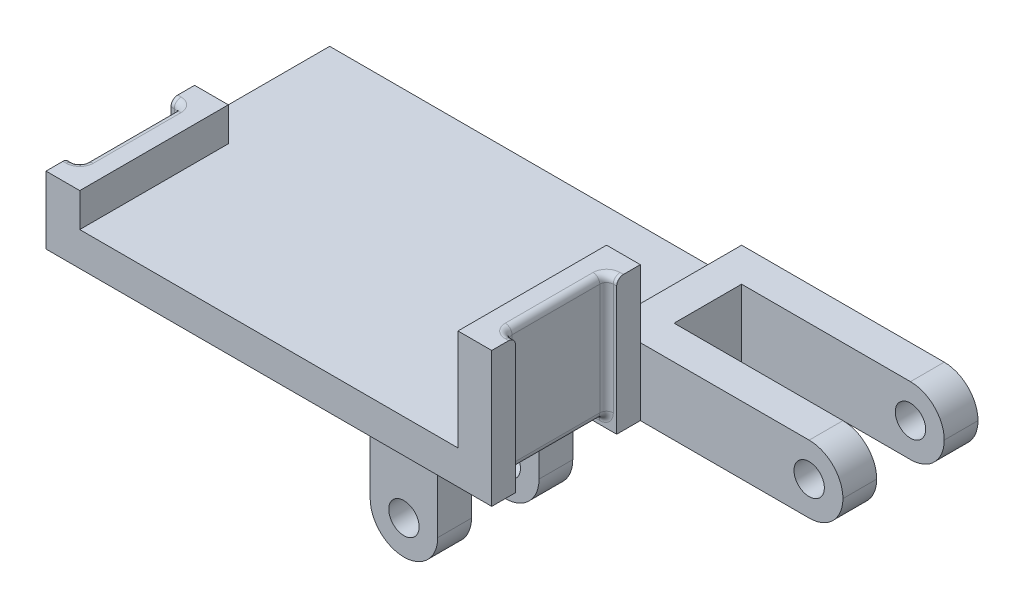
ISO-10303-21;
HEADER;
FILE_DESCRIPTION(('STEP AP214'),'2;1');
FILE_NAME('part.step','',(''),(''),'','','');
FILE_SCHEMA(('AUTOMOTIVE_DESIGN { 1 0 10303 214 1 1 1 1 }'));
ENDSEC;
DATA;
#1=APPLICATION_CONTEXT('core data for automotive mechanical design processes');
#2=APPLICATION_PROTOCOL_DEFINITION('international standard','automotive_design',2000,#1);
#3=PRODUCT_CONTEXT('',#1,'mechanical');
#4=PRODUCT('Part','Part','',(#3));
#5=PRODUCT_RELATED_PRODUCT_CATEGORY('part','',(#4));
#6=PRODUCT_DEFINITION_FORMATION('','',#4);
#7=PRODUCT_DEFINITION_CONTEXT('part definition',#1,'design');
#8=PRODUCT_DEFINITION('design','',#6,#7);
#9=PRODUCT_DEFINITION_SHAPE('','',#8);
#10=(LENGTH_UNIT() NAMED_UNIT(*) SI_UNIT(.MILLI.,.METRE.));
#11=(NAMED_UNIT(*) PLANE_ANGLE_UNIT() SI_UNIT($,.RADIAN.));
#12=(NAMED_UNIT(*) SI_UNIT($,.STERADIAN.) SOLID_ANGLE_UNIT());
#13=UNCERTAINTY_MEASURE_WITH_UNIT(LENGTH_MEASURE(1.E-05),#10,'distance_accuracy_value','');
#14=(GEOMETRIC_REPRESENTATION_CONTEXT(3) GLOBAL_UNCERTAINTY_ASSIGNED_CONTEXT((#13)) GLOBAL_UNIT_ASSIGNED_CONTEXT((#10,
#11,#12)) REPRESENTATION_CONTEXT('',''));
#15=CARTESIAN_POINT('',(0.,0.,0.));
#16=DIRECTION('',(0.,0.,1.));
#17=DIRECTION('',(1.,0.,0.));
#18=AXIS2_PLACEMENT_3D('',#15,#16,#17);
#19=CARTESIAN_POINT('',(66.,5.,0.));
#20=DIRECTION('',(-1.,0.,0.));
#21=DIRECTION('',(0.,0.,1.));
#22=AXIS2_PLACEMENT_3D('',#19,#20,#21);
#23=PLANE('',#22);
#24=DIRECTION('',(0.,-1.,0.));
#25=VECTOR('',#24,1.);
#26=CARTESIAN_POINT('',(66.,1.5,18.5));
#27=LINE('',#26,#25);
#28=CARTESIAN_POINT('',(66.,19.,18.5));
#29=VERTEX_POINT('',#28);
#30=CARTESIAN_POINT('',(66.,0.,18.5));
#31=VERTEX_POINT('',#30);
#32=EDGE_CURVE('E367',#29,#31,#27,.T.);
#33=ORIENTED_EDGE('',*,*,#32,.F.);
#34=CARTESIAN_POINT('',(66.,19.,19.5));
#35=DIRECTION('',(-1.,0.,0.));
#36=DIRECTION('',(0.,0.,1.));
#37=AXIS2_PLACEMENT_3D('',#34,#35,#36);
#38=CIRCLE('',#37,1.);
#39=CARTESIAN_POINT('',(66.,20.,19.5));
#40=VERTEX_POINT('',#39);
#41=EDGE_CURVE('E590',#29,#40,#38,.F.);
#42=ORIENTED_EDGE('',*,*,#41,.T.);
#43=DIRECTION('',(0.,0.,-1.));
#44=VECTOR('',#43,1.);
#45=CARTESIAN_POINT('',(66.,20.,0.));
#46=LINE('',#45,#44);
#47=CARTESIAN_POINT('',(66.,20.,22.));
#48=VERTEX_POINT('',#47);
#49=EDGE_CURVE('E479',#48,#40,#46,.T.);
#50=ORIENTED_EDGE('',*,*,#49,.F.);
#51=DIRECTION('',(0.,1.,0.));
#52=VECTOR('',#51,1.);
#53=CARTESIAN_POINT('',(66.,10.,22.));
#54=LINE('',#53,#52);
#55=CARTESIAN_POINT('',(66.,0.,22.));
#56=VERTEX_POINT('',#55);
#57=EDGE_CURVE('E776',#56,#48,#54,.T.);
#58=ORIENTED_EDGE('',*,*,#57,.F.);
#59=DIRECTION('',(0.,0.,-1.));
#60=VECTOR('',#59,1.);
#61=CARTESIAN_POINT('',(66.,0.,22.));
#62=LINE('',#61,#60);
#63=EDGE_CURVE('E384',#56,#31,#62,.T.);
#64=ORIENTED_EDGE('',*,*,#63,.T.);
#65=EDGE_LOOP('',(#33,#42,#50,#58,#64));
#66=FACE_BOUND('',#65,.T.);
#67=ADVANCED_FACE('F37',(#66),#23,.F.);
#68=CARTESIAN_POINT('',(0.,0.,0.));
#69=DIRECTION('',(0.,-1.,0.));
#70=DIRECTION('',(0.,0.,-1.));
#71=AXIS2_PLACEMENT_3D('',#68,#69,#70);
#72=PLANE('',#71);
#73=DIRECTION('',(-1.,0.,0.));
#74=VECTOR('',#73,1.);
#75=CARTESIAN_POINT('',(1.50000000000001,0.,18.5));
#76=LINE('',#75,#74);
#77=CARTESIAN_POINT('',(0.,0.,18.5));
#78=VERTEX_POINT('',#77);
#79=EDGE_CURVE('E377',#31,#78,#76,.T.);
#80=ORIENTED_EDGE('',*,*,#79,.F.);
#81=ORIENTED_EDGE('',*,*,#63,.F.);
#82=DIRECTION('',(1.,0.,0.));
#83=VECTOR('',#82,1.);
#84=CARTESIAN_POINT('',(36.,0.,22.));
#85=LINE('',#84,#83);
#86=CARTESIAN_POINT('',(0.,0.,22.));
#87=VERTEX_POINT('',#86);
#88=EDGE_CURVE('E773',#87,#56,#85,.T.);
#89=ORIENTED_EDGE('',*,*,#88,.F.);
#90=DIRECTION('',(0.,0.,1.));
#91=VECTOR('',#90,1.);
#92=CARTESIAN_POINT('',(0.,0.,0.));
#93=LINE('',#92,#91);
#94=EDGE_CURVE('E492',#78,#87,#93,.T.);
#95=ORIENTED_EDGE('',*,*,#94,.F.);
#96=EDGE_LOOP('',(#80,#81,#89,#95));
#97=FACE_BOUND('',#96,.T.);
#98=ADVANCED_FACE('F895',(#97),#72,.T.);
#99=CARTESIAN_POINT('',(1.5,0.,0.));
#100=DIRECTION('',(-1.,0.,0.));
#101=DIRECTION('',(0.,0.,1.));
#102=AXIS2_PLACEMENT_3D('',#99,#100,#101);
#103=PLANE('',#102);
#104=DIRECTION('',(0.,1.,0.));
#105=VECTOR('',#104,1.);
#106=CARTESIAN_POINT('',(1.50000000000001,0.,17.5));
#107=LINE('',#106,#105);
#108=CARTESIAN_POINT('',(1.50000000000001,2.5,17.5));
#109=VERTEX_POINT('',#108);
#110=CARTESIAN_POINT('',(1.50000000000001,9.,17.5));
#111=VERTEX_POINT('',#110);
#112=EDGE_CURVE('E46',#109,#111,#107,.T.);
#113=ORIENTED_EDGE('',*,*,#112,.T.);
#114=DIRECTION('',(0.,0.,-1.));
#115=VECTOR('',#114,1.);
#116=CARTESIAN_POINT('',(1.5,9.,0.));
#117=LINE('',#116,#115);
#118=CARTESIAN_POINT('',(1.5,9.,4.5));
#119=VERTEX_POINT('',#118);
#120=EDGE_CURVE('E11',#111,#119,#117,.T.);
#121=ORIENTED_EDGE('',*,*,#120,.T.);
#122=DIRECTION('',(0.,-1.,0.));
#123=VECTOR('',#122,1.);
#124=CARTESIAN_POINT('',(1.5,0.,4.5));
#125=LINE('',#124,#123);
#126=CARTESIAN_POINT('',(1.5,2.5,4.5));
#127=VERTEX_POINT('',#126);
#128=EDGE_CURVE('E655',#119,#127,#125,.T.);
#129=ORIENTED_EDGE('',*,*,#128,.T.);
#130=DIRECTION('',(0.,0.,1.));
#131=VECTOR('',#130,1.);
#132=CARTESIAN_POINT('',(1.5,2.5,0.));
#133=LINE('',#132,#131);
#134=EDGE_CURVE('E57',#127,#109,#133,.T.);
#135=ORIENTED_EDGE('',*,*,#134,.T.);
#136=EDGE_LOOP('',(#113,#121,#129,#135));
#137=FACE_BOUND('',#136,.T.);
#138=ADVANCED_FACE('F901',(#137),#103,.T.);
#139=CARTESIAN_POINT('',(0.,5.,0.));
#140=DIRECTION('',(1.,0.,0.));
#141=DIRECTION('',(0.,0.,-1.));
#142=AXIS2_PLACEMENT_3D('',#139,#140,#141);
#143=PLANE('',#142);
#144=DIRECTION('',(0.,0.,1.));
#145=VECTOR('',#144,1.);
#146=CARTESIAN_POINT('',(0.,10.,0.));
#147=LINE('',#146,#145);
#148=CARTESIAN_POINT('',(0.,10.,19.5));
#149=VERTEX_POINT('',#148);
#150=CARTESIAN_POINT('',(0.,10.,22.));
#151=VERTEX_POINT('',#150);
#152=EDGE_CURVE('E488',#149,#151,#147,.T.);
#153=ORIENTED_EDGE('',*,*,#152,.F.);
#154=CARTESIAN_POINT('',(0.,9.,19.5));
#155=DIRECTION('',(1.,0.,0.));
#156=DIRECTION('',(0.,0.,-1.));
#157=AXIS2_PLACEMENT_3D('',#154,#155,#156);
#158=CIRCLE('',#157,1.);
#159=CARTESIAN_POINT('',(0.,9.,18.5));
#160=VERTEX_POINT('',#159);
#161=EDGE_CURVE('E633',#149,#160,#158,.F.);
#162=ORIENTED_EDGE('',*,*,#161,.T.);
#163=DIRECTION('',(0.,1.,0.));
#164=VECTOR('',#163,1.);
#165=CARTESIAN_POINT('',(0.,0.,18.5));
#166=LINE('',#165,#164);
#167=EDGE_CURVE('E740',#78,#160,#166,.T.);
#168=ORIENTED_EDGE('',*,*,#167,.F.);
#169=ORIENTED_EDGE('',*,*,#94,.T.);
#170=DIRECTION('',(0.,-1.,0.));
#171=VECTOR('',#170,1.);
#172=CARTESIAN_POINT('',(0.,10.,22.));
#173=LINE('',#172,#171);
#174=EDGE_CURVE('E385',#151,#87,#173,.T.);
#175=ORIENTED_EDGE('',*,*,#174,.F.);
#176=EDGE_LOOP('',(#153,#162,#168,#169,#175));
#177=FACE_BOUND('',#176,.T.);
#178=ADVANCED_FACE('F908',(#177),#143,.F.);
#179=DIRECTION('',(0.,-1.,0.));
#180=VECTOR('',#179,1.);
#181=CARTESIAN_POINT('',(66.,0.,-15.));
#182=LINE('',#181,#180);
#183=CARTESIAN_POINT('',(66.,10.,-15.));
#184=VERTEX_POINT('',#183);
#185=CARTESIAN_POINT('',(66.,0.,-15.));
#186=VERTEX_POINT('',#185);
#187=EDGE_CURVE('E453',#184,#186,#182,.T.);
#188=ORIENTED_EDGE('',*,*,#187,.F.);
#189=DIRECTION('',(0.,0.,1.));
#190=VECTOR('',#189,1.);
#191=CARTESIAN_POINT('',(66.,10.,0.));
#192=LINE('',#191,#190);
#193=CARTESIAN_POINT('',(66.,10.,-5.));
#194=VERTEX_POINT('',#193);
#195=EDGE_CURVE('E759',#184,#194,#192,.T.);
#196=ORIENTED_EDGE('',*,*,#195,.T.);
#197=DIRECTION('',(0.,1.,0.));
#198=VECTOR('',#197,1.);
#199=CARTESIAN_POINT('',(66.,0.,-5.));
#200=LINE('',#199,#198);
#201=CARTESIAN_POINT('',(66.,0.,-5.));
#202=VERTEX_POINT('',#201);
#203=EDGE_CURVE('E464',#202,#194,#200,.T.);
#204=ORIENTED_EDGE('',*,*,#203,.F.);
#205=DIRECTION('',(0.,0.,-1.));
#206=VECTOR('',#205,1.);
#207=CARTESIAN_POINT('',(66.,0.,0.));
#208=LINE('',#207,#206);
#209=EDGE_CURVE('E501',#202,#186,#208,.T.);
#210=ORIENTED_EDGE('',*,*,#209,.T.);
#211=EDGE_LOOP('',(#188,#196,#204,#210));
#212=FACE_BOUND('',#211,.T.);
#213=ADVANCED_FACE('F819',(#212),#23,.F.);
#214=CARTESIAN_POINT('',(0.,5.,0.));
#215=DIRECTION('',(0.,0.,-1.));
#216=DIRECTION('',(-1.,0.,0.));
#217=AXIS2_PLACEMENT_3D('',#214,#215,#216);
#218=PLANE('',#217);
#219=CARTESIAN_POINT('',(91.,5.,0.));
#220=DIRECTION('',(0.,0.,-1.));
#221=DIRECTION('',(-1.,0.,0.));
#222=AXIS2_PLACEMENT_3D('',#219,#220,#221);
#223=CIRCLE('',#222,2.25);
#224=CARTESIAN_POINT('',(88.75,5.,0.));
#225=VERTEX_POINT('',#224);
#226=EDGE_CURVE('E442',#225,#225,#223,.T.);
#227=ORIENTED_EDGE('',*,*,#226,.T.);
#228=EDGE_LOOP('',(#227));
#229=FACE_BOUND('',#228,.T.);
#230=DIRECTION('',(0.,1.,0.));
#231=VECTOR('',#230,1.);
#232=CARTESIAN_POINT('',(66.,10.,0.));
#233=LINE('',#232,#231);
#234=CARTESIAN_POINT('',(66.,0.,0.));
#235=VERTEX_POINT('',#234);
#236=CARTESIAN_POINT('',(66.,10.,0.));
#237=VERTEX_POINT('',#236);
#238=EDGE_CURVE('E772',#235,#237,#233,.T.);
#239=ORIENTED_EDGE('',*,*,#238,.F.);
#240=DIRECTION('',(1.,0.,0.));
#241=VECTOR('',#240,1.);
#242=CARTESIAN_POINT('',(0.,0.,0.));
#243=LINE('',#242,#241);
#244=CARTESIAN_POINT('',(91.,0.,0.));
#245=VERTEX_POINT('',#244);
#246=EDGE_CURVE('E382',#235,#245,#243,.T.);
#247=ORIENTED_EDGE('',*,*,#246,.T.);
#248=CARTESIAN_POINT('',(91.,5.,0.));
#249=DIRECTION('',(0.,0.,-1.));
#250=DIRECTION('',(-1.,0.,0.));
#251=AXIS2_PLACEMENT_3D('',#248,#249,#250);
#252=CIRCLE('',#251,5.);
#253=CARTESIAN_POINT('',(96.,5.,0.));
#254=VERTEX_POINT('',#253);
#255=EDGE_CURVE('E519',#245,#254,#252,.F.);
#256=ORIENTED_EDGE('',*,*,#255,.T.);
#257=CARTESIAN_POINT('',(91.,5.,0.));
#258=DIRECTION('',(0.,0.,-1.));
#259=DIRECTION('',(-1.,0.,0.));
#260=AXIS2_PLACEMENT_3D('',#257,#258,#259);
#261=CIRCLE('',#260,5.);
#262=CARTESIAN_POINT('',(91.,10.,0.));
#263=VERTEX_POINT('',#262);
#264=EDGE_CURVE('E517',#254,#263,#261,.F.);
#265=ORIENTED_EDGE('',*,*,#264,.T.);
#266=DIRECTION('',(-1.,0.,0.));
#267=VECTOR('',#266,1.);
#268=CARTESIAN_POINT('',(96.,10.,0.));
#269=LINE('',#268,#267);
#270=EDGE_CURVE('E467',#263,#237,#269,.T.);
#271=ORIENTED_EDGE('',*,*,#270,.T.);
#272=EDGE_LOOP('',(#239,#247,#256,#265,#271));
#273=FACE_BOUND('',#272,.T.);
#274=ADVANCED_FACE('F793',(#229,#273),#218,.F.);
#275=CARTESIAN_POINT('',(31.,-30.,0.));
#276=DIRECTION('',(0.,0.,-1.));
#277=DIRECTION('',(-1.,0.,0.));
#278=AXIS2_PLACEMENT_3D('',#275,#276,#277);
#279=CIRCLE('',#278,2.25);
#280=CARTESIAN_POINT('',(28.75,-30.,0.));
#281=VERTEX_POINT('',#280);
#282=EDGE_CURVE('E388',#281,#281,#279,.T.);
#283=ORIENTED_EDGE('',*,*,#282,.T.);
#284=EDGE_LOOP('',(#283));
#285=FACE_BOUND('',#284,.T.);
#286=DIRECTION('',(1.,0.,0.));
#287=VECTOR('',#286,1.);
#288=CARTESIAN_POINT('',(36.,0.,0.));
#289=LINE('',#288,#287);
#290=CARTESIAN_POINT('',(26.,0.,0.));
#291=VERTEX_POINT('',#290);
#292=CARTESIAN_POINT('',(36.,0.,0.));
#293=VERTEX_POINT('',#292);
#294=EDGE_CURVE('E394',#291,#293,#289,.T.);
#295=ORIENTED_EDGE('',*,*,#294,.F.);
#296=DIRECTION('',(0.,1.,0.));
#297=VECTOR('',#296,1.);
#298=CARTESIAN_POINT('',(26.,-35.,0.));
#299=LINE('',#298,#297);
#300=CARTESIAN_POINT('',(26.,-30.,0.));
#301=VERTEX_POINT('',#300);
#302=EDGE_CURVE('E418',#301,#291,#299,.T.);
#303=ORIENTED_EDGE('',*,*,#302,.F.);
#304=CARTESIAN_POINT('',(31.,-30.,0.));
#305=DIRECTION('',(0.,0.,-1.));
#306=DIRECTION('',(-1.,0.,0.));
#307=AXIS2_PLACEMENT_3D('',#304,#305,#306);
#308=CIRCLE('',#307,5.);
#309=CARTESIAN_POINT('',(31.,-35.,0.));
#310=VERTEX_POINT('',#309);
#311=EDGE_CURVE('E552',#301,#310,#308,.F.);
#312=ORIENTED_EDGE('',*,*,#311,.T.);
#313=CARTESIAN_POINT('',(31.,-30.,0.));
#314=DIRECTION('',(0.,0.,-1.));
#315=DIRECTION('',(-1.,0.,0.));
#316=AXIS2_PLACEMENT_3D('',#313,#314,#315);
#317=CIRCLE('',#316,5.);
#318=CARTESIAN_POINT('',(36.,-30.,0.));
#319=VERTEX_POINT('',#318);
#320=EDGE_CURVE('E554',#310,#319,#317,.F.);
#321=ORIENTED_EDGE('',*,*,#320,.T.);
#322=DIRECTION('',(0.,1.,0.));
#323=VECTOR('',#322,1.);
#324=CARTESIAN_POINT('',(36.,-35.,0.));
#325=LINE('',#324,#323);
#326=EDGE_CURVE('E421',#319,#293,#325,.T.);
#327=ORIENTED_EDGE('',*,*,#326,.T.);
#328=EDGE_LOOP('',(#295,#303,#312,#321,#327));
#329=FACE_BOUND('',#328,.T.);
#330=ADVANCED_FACE('F915',(#285,#329),#218,.F.);
#331=CARTESIAN_POINT('',(66.,0.,3.5));
#332=VERTEX_POINT('',#331);
#333=EDGE_CURVE('E361',#332,#235,#62,.T.);
#334=ORIENTED_EDGE('',*,*,#333,.F.);
#335=DIRECTION('',(-1.,0.,0.));
#336=VECTOR('',#335,1.);
#337=CARTESIAN_POINT('',(1.5,0.,3.5));
#338=LINE('',#337,#336);
#339=CARTESIAN_POINT('',(0.,0.,3.5));
#340=VERTEX_POINT('',#339);
#341=EDGE_CURVE('E370',#332,#340,#338,.T.);
#342=ORIENTED_EDGE('',*,*,#341,.T.);
#343=CARTESIAN_POINT('',(0.,0.,-20.));
#344=VERTEX_POINT('',#343);
#345=EDGE_CURVE('E498',#344,#340,#93,.T.);
#346=ORIENTED_EDGE('',*,*,#345,.F.);
#347=DIRECTION('',(-1.,0.,0.));
#348=VECTOR('',#347,1.);
#349=CARTESIAN_POINT('',(0.,0.,-20.));
#350=LINE('',#349,#348);
#351=CARTESIAN_POINT('',(26.,0.,-20.));
#352=VERTEX_POINT('',#351);
#353=EDGE_CURVE('E504',#352,#344,#350,.T.);
#354=ORIENTED_EDGE('',*,*,#353,.F.);
#355=DIRECTION('',(0.,0.,-1.));
#356=VECTOR('',#355,1.);
#357=CARTESIAN_POINT('',(26.,0.,-15.));
#358=LINE('',#357,#356);
#359=CARTESIAN_POINT('',(26.,0.,-15.));
#360=VERTEX_POINT('',#359);
#361=EDGE_CURVE('E431',#360,#352,#358,.T.);
#362=ORIENTED_EDGE('',*,*,#361,.F.);
#363=DIRECTION('',(-1.,0.,0.));
#364=VECTOR('',#363,1.);
#365=CARTESIAN_POINT('',(36.,0.,-15.));
#366=LINE('',#365,#364);
#367=CARTESIAN_POINT('',(36.,0.,-15.));
#368=VERTEX_POINT('',#367);
#369=EDGE_CURVE('E428',#368,#360,#366,.T.);
#370=ORIENTED_EDGE('',*,*,#369,.F.);
#371=DIRECTION('',(0.,0.,1.));
#372=VECTOR('',#371,1.);
#373=CARTESIAN_POINT('',(36.,0.,-15.));
#374=LINE('',#373,#372);
#375=CARTESIAN_POINT('',(36.,0.,-20.));
#376=VERTEX_POINT('',#375);
#377=EDGE_CURVE('E425',#376,#368,#374,.T.);
#378=ORIENTED_EDGE('',*,*,#377,.F.);
#379=CARTESIAN_POINT('',(91.,0.,-20.));
#380=VERTEX_POINT('',#379);
#381=EDGE_CURVE('E497',#380,#376,#350,.T.);
#382=ORIENTED_EDGE('',*,*,#381,.F.);
#383=DIRECTION('',(0.,0.,-1.));
#384=VECTOR('',#383,1.);
#385=CARTESIAN_POINT('',(91.,0.,-15.));
#386=LINE('',#385,#384);
#387=CARTESIAN_POINT('',(91.,0.,-15.));
#388=VERTEX_POINT('',#387);
#389=EDGE_CURVE('E512',#380,#388,#386,.F.);
#390=ORIENTED_EDGE('',*,*,#389,.T.);
#391=DIRECTION('',(-1.,0.,0.));
#392=VECTOR('',#391,1.);
#393=CARTESIAN_POINT('',(96.,0.,-15.));
#394=LINE('',#393,#392);
#395=EDGE_CURVE('E462',#388,#186,#394,.T.);
#396=ORIENTED_EDGE('',*,*,#395,.T.);
#397=ORIENTED_EDGE('',*,*,#209,.F.);
#398=DIRECTION('',(-1.,0.,0.));
#399=VECTOR('',#398,1.);
#400=CARTESIAN_POINT('',(96.,0.,-5.));
#401=LINE('',#400,#399);
#402=CARTESIAN_POINT('',(91.,0.,-5.));
#403=VERTEX_POINT('',#402);
#404=EDGE_CURVE('E473',#403,#202,#401,.T.);
#405=ORIENTED_EDGE('',*,*,#404,.F.);
#406=DIRECTION('',(0.,0.,-1.));
#407=VECTOR('',#406,1.);
#408=CARTESIAN_POINT('',(91.,0.,0.));
#409=LINE('',#408,#407);
#410=EDGE_CURVE('E515',#403,#245,#409,.F.);
#411=ORIENTED_EDGE('',*,*,#410,.T.);
#412=ORIENTED_EDGE('',*,*,#246,.F.);
#413=EDGE_LOOP('',(#334,#342,#346,#354,#362,#370,#378,#382,#390,#396,#397,#405,#411,#412));
#414=FACE_BOUND('',#413,.T.);
#415=DIRECTION('',(0.,0.,-1.));
#416=VECTOR('',#415,1.);
#417=CARTESIAN_POINT('',(26.,0.,-5.00000000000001));
#418=LINE('',#417,#416);
#419=CARTESIAN_POINT('',(26.,0.,-5.00000000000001));
#420=VERTEX_POINT('',#419);
#421=EDGE_CURVE('E413',#291,#420,#418,.T.);
#422=ORIENTED_EDGE('',*,*,#421,.F.);
#423=ORIENTED_EDGE('',*,*,#294,.T.);
#424=DIRECTION('',(0.,0.,1.));
#425=VECTOR('',#424,1.);
#426=CARTESIAN_POINT('',(36.,0.,-5.00000000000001));
#427=LINE('',#426,#425);
#428=CARTESIAN_POINT('',(36.,0.,-5.00000000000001));
#429=VERTEX_POINT('',#428);
#430=EDGE_CURVE('E409',#429,#293,#427,.T.);
#431=ORIENTED_EDGE('',*,*,#430,.F.);
#432=DIRECTION('',(1.,0.,0.));
#433=VECTOR('',#432,1.);
#434=CARTESIAN_POINT('',(36.,0.,-5.00000000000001));
#435=LINE('',#434,#433);
#436=EDGE_CURVE('E406',#420,#429,#435,.T.);
#437=ORIENTED_EDGE('',*,*,#436,.F.);
#438=EDGE_LOOP('',(#422,#423,#431,#437));
#439=FACE_BOUND('',#438,.T.);
#440=ADVANCED_FACE('F379',(#414,#439),#72,.T.);
#441=CARTESIAN_POINT('',(66.,20.,2.49999999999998));
#442=VERTEX_POINT('',#441);
#443=CARTESIAN_POINT('',(66.,20.,0.));
#444=VERTEX_POINT('',#443);
#445=EDGE_CURVE('E478',#442,#444,#46,.T.);
#446=ORIENTED_EDGE('',*,*,#445,.F.);
#447=CARTESIAN_POINT('',(66.,19.,2.49999999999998));
#448=DIRECTION('',(-1.,0.,0.));
#449=DIRECTION('',(0.,0.,1.));
#450=AXIS2_PLACEMENT_3D('',#447,#448,#449);
#451=CIRCLE('',#450,1.);
#452=CARTESIAN_POINT('',(66.,19.,3.5));
#453=VERTEX_POINT('',#452);
#454=EDGE_CURVE('E364',#442,#453,#451,.F.);
#455=ORIENTED_EDGE('',*,*,#454,.T.);
#456=DIRECTION('',(0.,-1.,0.));
#457=VECTOR('',#456,1.);
#458=CARTESIAN_POINT('',(66.,1.5,3.5));
#459=LINE('',#458,#457);
#460=EDGE_CURVE('E355',#453,#332,#459,.T.);
#461=ORIENTED_EDGE('',*,*,#460,.T.);
#462=ORIENTED_EDGE('',*,*,#333,.T.);
#463=ORIENTED_EDGE('',*,*,#238,.T.);
#464=DIRECTION('',(0.,1.,0.));
#465=VECTOR('',#464,1.);
#466=CARTESIAN_POINT('',(66.,5.,0.));
#467=LINE('',#466,#465);
#468=EDGE_CURVE('E769',#237,#444,#467,.T.);
#469=ORIENTED_EDGE('',*,*,#468,.T.);
#470=EDGE_LOOP('',(#446,#455,#461,#462,#463,#469));
#471=FACE_BOUND('',#470,.T.);
#472=ADVANCED_FACE('F358',(#471),#23,.F.);
#473=CARTESIAN_POINT('',(0.,5.,0.));
#474=DIRECTION('',(0.,-1.,0.));
#475=DIRECTION('',(0.,0.,-1.));
#476=AXIS2_PLACEMENT_3D('',#473,#474,#475);
#477=PLANE('',#476);
#478=DIRECTION('',(-1.,0.,0.));
#479=VECTOR('',#478,1.);
#480=CARTESIAN_POINT('',(10.,5.,0.));
#481=LINE('',#480,#479);
#482=CARTESIAN_POINT('',(5.,5.,0.));
#483=VERTEX_POINT('',#482);
#484=CARTESIAN_POINT('',(0.,5.,0.));
#485=VERTEX_POINT('',#484);
#486=EDGE_CURVE('E751',#483,#485,#481,.T.);
#487=ORIENTED_EDGE('',*,*,#486,.F.);
#488=DIRECTION('',(0.,0.,1.));
#489=VECTOR('',#488,1.);
#490=CARTESIAN_POINT('',(5.,5.,0.));
#491=LINE('',#490,#489);
#492=CARTESIAN_POINT('',(5.,5.,22.));
#493=VERTEX_POINT('',#492);
#494=EDGE_CURVE('E485',#483,#493,#491,.T.);
#495=ORIENTED_EDGE('',*,*,#494,.T.);
#496=DIRECTION('',(-1.,0.,0.));
#497=VECTOR('',#496,1.);
#498=CARTESIAN_POINT('',(61.,5.,22.));
#499=LINE('',#498,#497);
#500=CARTESIAN_POINT('',(61.,5.,22.));
#501=VERTEX_POINT('',#500);
#502=EDGE_CURVE('E785',#501,#493,#499,.T.);
#503=ORIENTED_EDGE('',*,*,#502,.F.);
#504=DIRECTION('',(0.,0.,1.));
#505=VECTOR('',#504,1.);
#506=CARTESIAN_POINT('',(61.,5.,0.));
#507=LINE('',#506,#505);
#508=CARTESIAN_POINT('',(61.,5.,-20.));
#509=VERTEX_POINT('',#508);
#510=EDGE_CURVE('E475',#509,#501,#507,.T.);
#511=ORIENTED_EDGE('',*,*,#510,.F.);
#512=DIRECTION('',(-1.,0.,0.));
#513=VECTOR('',#512,1.);
#514=CARTESIAN_POINT('',(0.,5.,-20.));
#515=LINE('',#514,#513);
#516=CARTESIAN_POINT('',(0.,5.,-20.));
#517=VERTEX_POINT('',#516);
#518=EDGE_CURVE('E494',#509,#517,#515,.T.);
#519=ORIENTED_EDGE('',*,*,#518,.T.);
#520=DIRECTION('',(0.,0.,1.));
#521=VECTOR('',#520,1.);
#522=CARTESIAN_POINT('',(0.,5.,-20.));
#523=LINE('',#522,#521);
#524=EDGE_CURVE('E745',#517,#485,#523,.T.);
#525=ORIENTED_EDGE('',*,*,#524,.T.);
#526=EDGE_LOOP('',(#487,#495,#503,#511,#519,#525));
#527=FACE_BOUND('',#526,.T.);
#528=ADVANCED_FACE('F864',(#527),#477,.F.);
#529=DIRECTION('',(0.,-1.,0.));
#530=VECTOR('',#529,1.);
#531=CARTESIAN_POINT('',(0.,0.,3.5));
#532=LINE('',#531,#530);
#533=CARTESIAN_POINT('',(0.,9.,3.5));
#534=VERTEX_POINT('',#533);
#535=EDGE_CURVE('E373',#534,#340,#532,.T.);
#536=ORIENTED_EDGE('',*,*,#535,.F.);
#537=CARTESIAN_POINT('',(0.,9.,2.5));
#538=DIRECTION('',(1.,0.,0.));
#539=DIRECTION('',(0.,0.,-1.));
#540=AXIS2_PLACEMENT_3D('',#537,#538,#539);
#541=CIRCLE('',#540,1.);
#542=CARTESIAN_POINT('',(0.,10.,2.5));
#543=VERTEX_POINT('',#542);
#544=EDGE_CURVE('E635',#534,#543,#541,.F.);
#545=ORIENTED_EDGE('',*,*,#544,.T.);
#546=CARTESIAN_POINT('',(0.,10.,0.));
#547=VERTEX_POINT('',#546);
#548=EDGE_CURVE('E489',#547,#543,#147,.T.);
#549=ORIENTED_EDGE('',*,*,#548,.F.);
#550=DIRECTION('',(0.,1.,0.));
#551=VECTOR('',#550,1.);
#552=CARTESIAN_POINT('',(0.,10.,0.));
#553=LINE('',#552,#551);
#554=EDGE_CURVE('E749',#485,#547,#553,.T.);
#555=ORIENTED_EDGE('',*,*,#554,.F.);
#556=ORIENTED_EDGE('',*,*,#524,.F.);
#557=DIRECTION('',(0.,-1.,0.));
#558=VECTOR('',#557,1.);
#559=CARTESIAN_POINT('',(0.,5.,-20.));
#560=LINE('',#559,#558);
#561=EDGE_CURVE('E496',#517,#344,#560,.T.);
#562=ORIENTED_EDGE('',*,*,#561,.T.);
#563=ORIENTED_EDGE('',*,*,#345,.T.);
#564=EDGE_LOOP('',(#536,#545,#549,#555,#556,#562,#563));
#565=FACE_BOUND('',#564,.T.);
#566=ADVANCED_FACE('F738',(#565),#143,.F.);
#567=CARTESIAN_POINT('',(0.,5.,-20.));
#568=DIRECTION('',(0.,0.,1.));
#569=DIRECTION('',(1.,0.,0.));
#570=AXIS2_PLACEMENT_3D('',#567,#568,#569);
#571=PLANE('',#570);
#572=CARTESIAN_POINT('',(31.,-30.,-20.));
#573=DIRECTION('',(0.,0.,1.));
#574=DIRECTION('',(1.,0.,0.));
#575=AXIS2_PLACEMENT_3D('',#572,#573,#574);
#576=CIRCLE('',#575,2.25);
#577=CARTESIAN_POINT('',(33.25,-30.,-20.));
#578=VERTEX_POINT('',#577);
#579=EDGE_CURVE('E402',#578,#578,#576,.T.);
#580=ORIENTED_EDGE('',*,*,#579,.T.);
#581=EDGE_LOOP('',(#580));
#582=FACE_BOUND('',#581,.T.);
#583=CARTESIAN_POINT('',(91.,5.,-20.));
#584=DIRECTION('',(0.,0.,1.));
#585=DIRECTION('',(1.,0.,0.));
#586=AXIS2_PLACEMENT_3D('',#583,#584,#585);
#587=CIRCLE('',#586,2.25);
#588=CARTESIAN_POINT('',(93.25,5.,-20.));
#589=VERTEX_POINT('',#588);
#590=EDGE_CURVE('E449',#589,#589,#587,.T.);
#591=ORIENTED_EDGE('',*,*,#590,.T.);
#592=EDGE_LOOP('',(#591));
#593=FACE_BOUND('',#592,.T.);
#594=ORIENTED_EDGE('',*,*,#561,.F.);
#595=ORIENTED_EDGE('',*,*,#518,.F.);
#596=DIRECTION('',(0.,-1.,0.));
#597=VECTOR('',#596,1.);
#598=CARTESIAN_POINT('',(61.,20.,-20.));
#599=LINE('',#598,#597);
#600=CARTESIAN_POINT('',(61.,10.,-20.));
#601=VERTEX_POINT('',#600);
#602=EDGE_CURVE('E482',#601,#509,#599,.T.);
#603=ORIENTED_EDGE('',*,*,#602,.F.);
#604=DIRECTION('',(-1.,0.,0.));
#605=VECTOR('',#604,1.);
#606=CARTESIAN_POINT('',(96.,10.,-20.));
#607=LINE('',#606,#605);
#608=CARTESIAN_POINT('',(91.,10.,-20.));
#609=VERTEX_POINT('',#608);
#610=EDGE_CURVE('E460',#609,#601,#607,.T.);
#611=ORIENTED_EDGE('',*,*,#610,.F.);
#612=CARTESIAN_POINT('',(91.,5.,-20.));
#613=DIRECTION('',(0.,0.,1.));
#614=DIRECTION('',(1.,0.,0.));
#615=AXIS2_PLACEMENT_3D('',#612,#613,#614);
#616=CIRCLE('',#615,5.);
#617=CARTESIAN_POINT('',(96.,5.,-20.));
#618=VERTEX_POINT('',#617);
#619=EDGE_CURVE('E523',#609,#618,#616,.F.);
#620=ORIENTED_EDGE('',*,*,#619,.T.);
#621=CARTESIAN_POINT('',(91.,5.,-20.));
#622=DIRECTION('',(0.,0.,1.));
#623=DIRECTION('',(1.,0.,0.));
#624=AXIS2_PLACEMENT_3D('',#621,#622,#623);
#625=CIRCLE('',#624,5.);
#626=EDGE_CURVE('E525',#618,#380,#625,.F.);
#627=ORIENTED_EDGE('',*,*,#626,.T.);
#628=ORIENTED_EDGE('',*,*,#381,.T.);
#629=DIRECTION('',(0.,1.,0.));
#630=VECTOR('',#629,1.);
#631=CARTESIAN_POINT('',(36.,-35.,-20.));
#632=LINE('',#631,#630);
#633=CARTESIAN_POINT('',(36.,-30.,-20.));
#634=VERTEX_POINT('',#633);
#635=EDGE_CURVE('E434',#634,#376,#632,.T.);
#636=ORIENTED_EDGE('',*,*,#635,.F.);
#637=CARTESIAN_POINT('',(31.,-30.,-20.));
#638=DIRECTION('',(0.,0.,1.));
#639=DIRECTION('',(1.,0.,0.));
#640=AXIS2_PLACEMENT_3D('',#637,#638,#639);
#641=CIRCLE('',#640,5.);
#642=CARTESIAN_POINT('',(31.,-35.,-20.));
#643=VERTEX_POINT('',#642);
#644=EDGE_CURVE('E533',#634,#643,#641,.F.);
#645=ORIENTED_EDGE('',*,*,#644,.T.);
#646=CARTESIAN_POINT('',(31.,-30.,-20.));
#647=DIRECTION('',(0.,0.,1.));
#648=DIRECTION('',(1.,0.,0.));
#649=AXIS2_PLACEMENT_3D('',#646,#647,#648);
#650=CIRCLE('',#649,5.);
#651=CARTESIAN_POINT('',(26.,-30.,-20.));
#652=VERTEX_POINT('',#651);
#653=EDGE_CURVE('E541',#643,#652,#650,.F.);
#654=ORIENTED_EDGE('',*,*,#653,.T.);
#655=DIRECTION('',(0.,1.,0.));
#656=VECTOR('',#655,1.);
#657=CARTESIAN_POINT('',(26.,-35.,-20.));
#658=LINE('',#657,#656);
#659=EDGE_CURVE('E436',#652,#352,#658,.T.);
#660=ORIENTED_EDGE('',*,*,#659,.T.);
#661=ORIENTED_EDGE('',*,*,#353,.T.);
#662=EDGE_LOOP('',(#594,#595,#603,#611,#620,#627,#628,#636,#645,#654,#660,#661));
#663=FACE_BOUND('',#662,.T.);
#664=ADVANCED_FACE('F833',(#582,#593,#663),#571,.F.);
#665=CARTESIAN_POINT('',(5.,10.,0.));
#666=DIRECTION('',(1.,0.,0.));
#667=DIRECTION('',(0.,0.,-1.));
#668=AXIS2_PLACEMENT_3D('',#665,#666,#667);
#669=PLANE('',#668);
#670=DIRECTION('',(0.,-1.,0.));
#671=VECTOR('',#670,1.);
#672=CARTESIAN_POINT('',(5.,10.,0.));
#673=LINE('',#672,#671);
#674=CARTESIAN_POINT('',(5.,10.,0.));
#675=VERTEX_POINT('',#674);
#676=EDGE_CURVE('E753',#675,#483,#673,.T.);
#677=ORIENTED_EDGE('',*,*,#676,.F.);
#678=DIRECTION('',(0.,0.,1.));
#679=VECTOR('',#678,1.);
#680=CARTESIAN_POINT('',(5.,10.,0.));
#681=LINE('',#680,#679);
#682=CARTESIAN_POINT('',(5.,10.,22.));
#683=VERTEX_POINT('',#682);
#684=EDGE_CURVE('E486',#675,#683,#681,.T.);
#685=ORIENTED_EDGE('',*,*,#684,.T.);
#686=DIRECTION('',(0.,1.,0.));
#687=VECTOR('',#686,1.);
#688=CARTESIAN_POINT('',(5.,5.,22.));
#689=LINE('',#688,#687);
#690=EDGE_CURVE('E788',#493,#683,#689,.T.);
#691=ORIENTED_EDGE('',*,*,#690,.F.);
#692=ORIENTED_EDGE('',*,*,#494,.F.);
#693=EDGE_LOOP('',(#677,#685,#691,#692));
#694=FACE_BOUND('',#693,.T.);
#695=ADVANCED_FACE('F922',(#694),#669,.T.);
#696=CARTESIAN_POINT('',(0.,10.,0.));
#697=DIRECTION('',(0.,1.,0.));
#698=DIRECTION('',(0.,0.,1.));
#699=AXIS2_PLACEMENT_3D('',#696,#697,#698);
#700=PLANE('',#699);
#701=CARTESIAN_POINT('',(0.500000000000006,10.,17.5));
#702=DIRECTION('',(0.,1.,0.));
#703=DIRECTION('',(0.,0.,1.));
#704=AXIS2_PLACEMENT_3D('',#701,#702,#703);
#705=CIRCLE('',#704,2.);
#706=CARTESIAN_POINT('',(0.500000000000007,10.,19.5));
#707=VERTEX_POINT('',#706);
#708=CARTESIAN_POINT('',(2.50000000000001,10.,17.5));
#709=VERTEX_POINT('',#708);
#710=EDGE_CURVE('E621',#707,#709,#705,.T.);
#711=ORIENTED_EDGE('',*,*,#710,.F.);
#712=DIRECTION('',(-1.,0.,0.));
#713=VECTOR('',#712,1.);
#714=CARTESIAN_POINT('',(0.,10.,19.5));
#715=LINE('',#714,#713);
#716=EDGE_CURVE('E631',#707,#149,#715,.T.);
#717=ORIENTED_EDGE('',*,*,#716,.T.);
#718=ORIENTED_EDGE('',*,*,#152,.T.);
#719=DIRECTION('',(-1.,0.,0.));
#720=VECTOR('',#719,1.);
#721=CARTESIAN_POINT('',(5.,10.,22.));
#722=LINE('',#721,#720);
#723=EDGE_CURVE('E390',#683,#151,#722,.T.);
#724=ORIENTED_EDGE('',*,*,#723,.F.);
#725=ORIENTED_EDGE('',*,*,#684,.F.);
#726=DIRECTION('',(1.,0.,0.));
#727=VECTOR('',#726,1.);
#728=CARTESIAN_POINT('',(0.,10.,0.));
#729=LINE('',#728,#727);
#730=EDGE_CURVE('E571',#547,#675,#729,.T.);
#731=ORIENTED_EDGE('',*,*,#730,.F.);
#732=ORIENTED_EDGE('',*,*,#548,.T.);
#733=DIRECTION('',(-1.,0.,0.));
#734=VECTOR('',#733,1.);
#735=CARTESIAN_POINT('',(1.5,10.,2.5));
#736=LINE('',#735,#734);
#737=CARTESIAN_POINT('',(0.500000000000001,10.,2.5));
#738=VERTEX_POINT('',#737);
#739=EDGE_CURVE('E629',#543,#738,#736,.F.);
#740=ORIENTED_EDGE('',*,*,#739,.T.);
#741=CARTESIAN_POINT('',(0.500000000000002,10.,4.5));
#742=DIRECTION('',(0.,1.,0.));
#743=DIRECTION('',(0.,0.,1.));
#744=AXIS2_PLACEMENT_3D('',#741,#742,#743);
#745=CIRCLE('',#744,2.);
#746=CARTESIAN_POINT('',(2.5,10.,4.5));
#747=VERTEX_POINT('',#746);
#748=EDGE_CURVE('E626',#747,#738,#745,.T.);
#749=ORIENTED_EDGE('',*,*,#748,.F.);
#750=DIRECTION('',(0.,0.,-1.));
#751=VECTOR('',#750,1.);
#752=CARTESIAN_POINT('',(2.5,10.,0.));
#753=LINE('',#752,#751);
#754=EDGE_CURVE('E624',#747,#709,#753,.F.);
#755=ORIENTED_EDGE('',*,*,#754,.T.);
#756=EDGE_LOOP('',(#711,#717,#718,#724,#725,#731,#732,#740,#749,#755));
#757=FACE_BOUND('',#756,.T.);
#758=ADVANCED_FACE('F928',(#757),#700,.T.);
#759=CARTESIAN_POINT('',(61.,20.,0.));
#760=DIRECTION('',(1.,0.,0.));
#761=DIRECTION('',(0.,0.,-1.));
#762=AXIS2_PLACEMENT_3D('',#759,#760,#761);
#763=PLANE('',#762);
#764=DIRECTION('',(0.,-1.,0.));
#765=VECTOR('',#764,1.);
#766=CARTESIAN_POINT('',(61.,20.,0.));
#767=LINE('',#766,#765);
#768=CARTESIAN_POINT('',(61.,20.,0.));
#769=VERTEX_POINT('',#768);
#770=CARTESIAN_POINT('',(61.,10.,0.));
#771=VERTEX_POINT('',#770);
#772=EDGE_CURVE('E766',#769,#771,#767,.T.);
#773=ORIENTED_EDGE('',*,*,#772,.T.);
#774=DIRECTION('',(0.,0.,-1.));
#775=VECTOR('',#774,1.);
#776=CARTESIAN_POINT('',(61.,10.,0.));
#777=LINE('',#776,#775);
#778=EDGE_CURVE('E763',#771,#601,#777,.T.);
#779=ORIENTED_EDGE('',*,*,#778,.T.);
#780=ORIENTED_EDGE('',*,*,#602,.T.);
#781=ORIENTED_EDGE('',*,*,#510,.T.);
#782=DIRECTION('',(0.,-1.,0.));
#783=VECTOR('',#782,1.);
#784=CARTESIAN_POINT('',(61.,20.,22.));
#785=LINE('',#784,#783);
#786=CARTESIAN_POINT('',(61.,20.,22.));
#787=VERTEX_POINT('',#786);
#788=EDGE_CURVE('E782',#787,#501,#785,.T.);
#789=ORIENTED_EDGE('',*,*,#788,.F.);
#790=DIRECTION('',(0.,0.,1.));
#791=VECTOR('',#790,1.);
#792=CARTESIAN_POINT('',(61.,20.,0.));
#793=LINE('',#792,#791);
#794=EDGE_CURVE('E476',#769,#787,#793,.T.);
#795=ORIENTED_EDGE('',*,*,#794,.F.);
#796=EDGE_LOOP('',(#773,#779,#780,#781,#789,#795));
#797=FACE_BOUND('',#796,.T.);
#798=ADVANCED_FACE('F870',(#797),#763,.F.);
#799=CARTESIAN_POINT('',(0.,20.,0.));
#800=DIRECTION('',(0.,1.,0.));
#801=DIRECTION('',(0.,0.,1.));
#802=AXIS2_PLACEMENT_3D('',#799,#800,#801);
#803=PLANE('',#802);
#804=ORIENTED_EDGE('',*,*,#49,.T.);
#805=DIRECTION('',(1.,0.,0.));
#806=VECTOR('',#805,1.);
#807=CARTESIAN_POINT('',(64.5,20.,19.5));
#808=LINE('',#807,#806);
#809=CARTESIAN_POINT('',(65.5,20.,19.5));
#810=VERTEX_POINT('',#809);
#811=EDGE_CURVE('E602',#40,#810,#808,.F.);
#812=ORIENTED_EDGE('',*,*,#811,.T.);
#813=CARTESIAN_POINT('',(65.5,20.,17.5));
#814=DIRECTION('',(0.,1.,0.));
#815=DIRECTION('',(0.,0.,1.));
#816=AXIS2_PLACEMENT_3D('',#813,#814,#815);
#817=CIRCLE('',#816,2.);
#818=CARTESIAN_POINT('',(63.5,20.,17.5));
#819=VERTEX_POINT('',#818);
#820=EDGE_CURVE('E599',#819,#810,#817,.T.);
#821=ORIENTED_EDGE('',*,*,#820,.F.);
#822=DIRECTION('',(0.,0.,1.));
#823=VECTOR('',#822,1.);
#824=CARTESIAN_POINT('',(63.5,20.,3.5));
#825=LINE('',#824,#823);
#826=CARTESIAN_POINT('',(63.5,20.,4.49999999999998));
#827=VERTEX_POINT('',#826);
#828=EDGE_CURVE('E595',#819,#827,#825,.F.);
#829=ORIENTED_EDGE('',*,*,#828,.T.);
#830=CARTESIAN_POINT('',(65.5,20.,4.49999999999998));
#831=DIRECTION('',(0.,1.,0.));
#832=DIRECTION('',(0.,0.,1.));
#833=AXIS2_PLACEMENT_3D('',#830,#831,#832);
#834=CIRCLE('',#833,2.);
#835=CARTESIAN_POINT('',(65.5,20.,2.49999999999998));
#836=VERTEX_POINT('',#835);
#837=EDGE_CURVE('E592',#836,#827,#834,.T.);
#838=ORIENTED_EDGE('',*,*,#837,.F.);
#839=DIRECTION('',(1.,0.,0.));
#840=VECTOR('',#839,1.);
#841=CARTESIAN_POINT('',(66.,20.,2.49999999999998));
#842=LINE('',#841,#840);
#843=EDGE_CURVE('E597',#836,#442,#842,.T.);
#844=ORIENTED_EDGE('',*,*,#843,.T.);
#845=ORIENTED_EDGE('',*,*,#445,.T.);
#846=DIRECTION('',(1.,0.,0.));
#847=VECTOR('',#846,1.);
#848=CARTESIAN_POINT('',(0.,20.,0.));
#849=LINE('',#848,#847);
#850=EDGE_CURVE('E755',#769,#444,#849,.T.);
#851=ORIENTED_EDGE('',*,*,#850,.F.);
#852=ORIENTED_EDGE('',*,*,#794,.T.);
#853=DIRECTION('',(-1.,0.,0.));
#854=VECTOR('',#853,1.);
#855=CARTESIAN_POINT('',(66.,20.,22.));
#856=LINE('',#855,#854);
#857=EDGE_CURVE('E779',#48,#787,#856,.T.);
#858=ORIENTED_EDGE('',*,*,#857,.F.);
#859=EDGE_LOOP('',(#804,#812,#821,#829,#838,#844,#845,#851,#852,#858));
#860=FACE_BOUND('',#859,.T.);
#861=ADVANCED_FACE('F877',(#860),#803,.T.);
#862=CARTESIAN_POINT('',(96.,0.,-5.));
#863=DIRECTION('',(0.,0.,1.));
#864=DIRECTION('',(1.,0.,0.));
#865=AXIS2_PLACEMENT_3D('',#862,#863,#864);
#866=PLANE('',#865);
#867=CARTESIAN_POINT('',(91.,5.,-5.));
#868=DIRECTION('',(0.,0.,1.));
#869=DIRECTION('',(1.,0.,0.));
#870=AXIS2_PLACEMENT_3D('',#867,#868,#869);
#871=CIRCLE('',#870,2.25);
#872=CARTESIAN_POINT('',(93.25,5.,-5.));
#873=VERTEX_POINT('',#872);
#874=EDGE_CURVE('E446',#873,#873,#871,.T.);
#875=ORIENTED_EDGE('',*,*,#874,.T.);
#876=EDGE_LOOP('',(#875));
#877=FACE_BOUND('',#876,.T.);
#878=CARTESIAN_POINT('',(91.,5.,-5.));
#879=DIRECTION('',(0.,0.,1.));
#880=DIRECTION('',(1.,0.,0.));
#881=AXIS2_PLACEMENT_3D('',#878,#879,#880);
#882=CIRCLE('',#881,5.);
#883=CARTESIAN_POINT('',(91.,10.,-5.));
#884=VERTEX_POINT('',#883);
#885=CARTESIAN_POINT('',(96.,5.,-5.));
#886=VERTEX_POINT('',#885);
#887=EDGE_CURVE('E508',#884,#886,#882,.F.);
#888=ORIENTED_EDGE('',*,*,#887,.T.);
#889=CARTESIAN_POINT('',(91.,5.,-5.));
#890=DIRECTION('',(0.,0.,1.));
#891=DIRECTION('',(1.,0.,0.));
#892=AXIS2_PLACEMENT_3D('',#889,#890,#891);
#893=CIRCLE('',#892,5.);
#894=EDGE_CURVE('E510',#886,#403,#893,.F.);
#895=ORIENTED_EDGE('',*,*,#894,.T.);
#896=ORIENTED_EDGE('',*,*,#404,.T.);
#897=ORIENTED_EDGE('',*,*,#203,.T.);
#898=DIRECTION('',(-1.,0.,0.));
#899=VECTOR('',#898,1.);
#900=CARTESIAN_POINT('',(96.,10.,-5.));
#901=LINE('',#900,#899);
#902=EDGE_CURVE('E470',#884,#194,#901,.T.);
#903=ORIENTED_EDGE('',*,*,#902,.F.);
#904=EDGE_LOOP('',(#888,#895,#896,#897,#903));
#905=FACE_BOUND('',#904,.T.);
#906=ADVANCED_FACE('F808',(#877,#905),#866,.F.);
#907=CARTESIAN_POINT('',(96.,10.,0.));
#908=DIRECTION('',(0.,-1.,0.));
#909=DIRECTION('',(0.,0.,-1.));
#910=AXIS2_PLACEMENT_3D('',#907,#908,#909);
#911=PLANE('',#910);
#912=ORIENTED_EDGE('',*,*,#270,.F.);
#913=DIRECTION('',(0.,0.,1.));
#914=VECTOR('',#913,1.);
#915=CARTESIAN_POINT('',(91.,10.,0.));
#916=LINE('',#915,#914);
#917=EDGE_CURVE('E521',#263,#884,#916,.F.);
#918=ORIENTED_EDGE('',*,*,#917,.T.);
#919=ORIENTED_EDGE('',*,*,#902,.T.);
#920=ORIENTED_EDGE('',*,*,#195,.F.);
#921=DIRECTION('',(-1.,0.,0.));
#922=VECTOR('',#921,1.);
#923=CARTESIAN_POINT('',(96.,10.,-15.));
#924=LINE('',#923,#922);
#925=CARTESIAN_POINT('',(91.,10.,-15.));
#926=VERTEX_POINT('',#925);
#927=EDGE_CURVE('E456',#926,#184,#924,.T.);
#928=ORIENTED_EDGE('',*,*,#927,.F.);
#929=DIRECTION('',(0.,0.,1.));
#930=VECTOR('',#929,1.);
#931=CARTESIAN_POINT('',(91.,10.,-15.));
#932=LINE('',#931,#930);
#933=EDGE_CURVE('E531',#926,#609,#932,.F.);
#934=ORIENTED_EDGE('',*,*,#933,.T.);
#935=ORIENTED_EDGE('',*,*,#610,.T.);
#936=ORIENTED_EDGE('',*,*,#778,.F.);
#937=DIRECTION('',(1.,0.,0.));
#938=VECTOR('',#937,1.);
#939=CARTESIAN_POINT('',(0.,10.,0.));
#940=LINE('',#939,#938);
#941=EDGE_CURVE('E756',#771,#237,#940,.T.);
#942=ORIENTED_EDGE('',*,*,#941,.T.);
#943=EDGE_LOOP('',(#912,#918,#919,#920,#928,#934,#935,#936,#942));
#944=FACE_BOUND('',#943,.T.);
#945=ADVANCED_FACE('F799',(#944),#911,.F.);
#946=CARTESIAN_POINT('',(96.,0.,-15.));
#947=DIRECTION('',(0.,0.,-1.));
#948=DIRECTION('',(-1.,0.,0.));
#949=AXIS2_PLACEMENT_3D('',#946,#947,#948);
#950=PLANE('',#949);
#951=CARTESIAN_POINT('',(91.,5.,-15.));
#952=DIRECTION('',(0.,0.,-1.));
#953=DIRECTION('',(-1.,0.,0.));
#954=AXIS2_PLACEMENT_3D('',#951,#952,#953);
#955=CIRCLE('',#954,2.25);
#956=CARTESIAN_POINT('',(88.75,5.,-15.));
#957=VERTEX_POINT('',#956);
#958=EDGE_CURVE('E445',#957,#957,#955,.T.);
#959=ORIENTED_EDGE('',*,*,#958,.T.);
#960=EDGE_LOOP('',(#959));
#961=FACE_BOUND('',#960,.T.);
#962=ORIENTED_EDGE('',*,*,#395,.F.);
#963=CARTESIAN_POINT('',(91.,5.,-15.));
#964=DIRECTION('',(0.,0.,-1.));
#965=DIRECTION('',(-1.,0.,0.));
#966=AXIS2_PLACEMENT_3D('',#963,#964,#965);
#967=CIRCLE('',#966,5.);
#968=CARTESIAN_POINT('',(96.,5.,-15.));
#969=VERTEX_POINT('',#968);
#970=EDGE_CURVE('E529',#388,#969,#967,.F.);
#971=ORIENTED_EDGE('',*,*,#970,.T.);
#972=CARTESIAN_POINT('',(91.,5.,-15.));
#973=DIRECTION('',(0.,0.,-1.));
#974=DIRECTION('',(-1.,0.,0.));
#975=AXIS2_PLACEMENT_3D('',#972,#973,#974);
#976=CIRCLE('',#975,5.);
#977=EDGE_CURVE('E527',#969,#926,#976,.F.);
#978=ORIENTED_EDGE('',*,*,#977,.T.);
#979=ORIENTED_EDGE('',*,*,#927,.T.);
#980=ORIENTED_EDGE('',*,*,#187,.T.);
#981=EDGE_LOOP('',(#962,#971,#978,#979,#980));
#982=FACE_BOUND('',#981,.T.);
#983=ADVANCED_FACE('F817',(#961,#982),#950,.F.);
#984=CARTESIAN_POINT('',(91.,5.,0.));
#985=DIRECTION('',(0.,0.,1.));
#986=DIRECTION('',(1.,0.,0.));
#987=AXIS2_PLACEMENT_3D('',#984,#985,#986);
#988=CYLINDRICAL_SURFACE('',#987,5.);
#989=ORIENTED_EDGE('',*,*,#917,.F.);
#990=ORIENTED_EDGE('',*,*,#264,.F.);
#991=DIRECTION('',(0.,0.,1.));
#992=VECTOR('',#991,1.);
#993=CARTESIAN_POINT('',(96.,5.,0.));
#994=LINE('',#993,#992);
#995=EDGE_CURVE('E457',#886,#254,#994,.T.);
#996=ORIENTED_EDGE('',*,*,#995,.F.);
#997=ORIENTED_EDGE('',*,*,#887,.F.);
#998=EDGE_LOOP('',(#989,#990,#996,#997));
#999=FACE_BOUND('',#998,.T.);
#1000=ADVANCED_FACE('F804',(#999),#988,.T.);
#1001=CARTESIAN_POINT('',(91.,5.,0.));
#1002=DIRECTION('',(0.,0.,1.));
#1003=DIRECTION('',(1.,0.,0.));
#1004=AXIS2_PLACEMENT_3D('',#1001,#1002,#1003);
#1005=CYLINDRICAL_SURFACE('',#1004,5.);
#1006=ORIENTED_EDGE('',*,*,#255,.F.);
#1007=ORIENTED_EDGE('',*,*,#410,.F.);
#1008=ORIENTED_EDGE('',*,*,#894,.F.);
#1009=ORIENTED_EDGE('',*,*,#995,.T.);
#1010=EDGE_LOOP('',(#1006,#1007,#1008,#1009));
#1011=FACE_BOUND('',#1010,.T.);
#1012=ADVANCED_FACE('F1288',(#1011),#1005,.T.);
#1013=CARTESIAN_POINT('',(91.,5.,0.));
#1014=DIRECTION('',(0.,0.,1.));
#1015=DIRECTION('',(1.,0.,0.));
#1016=AXIS2_PLACEMENT_3D('',#1013,#1014,#1015);
#1017=CYLINDRICAL_SURFACE('',#1016,5.);
#1018=ORIENTED_EDGE('',*,*,#933,.F.);
#1019=ORIENTED_EDGE('',*,*,#977,.F.);
#1020=DIRECTION('',(0.,0.,1.));
#1021=VECTOR('',#1020,1.);
#1022=CARTESIAN_POINT('',(96.,5.,0.));
#1023=LINE('',#1022,#1021);
#1024=EDGE_CURVE('E452',#618,#969,#1023,.T.);
#1025=ORIENTED_EDGE('',*,*,#1024,.F.);
#1026=ORIENTED_EDGE('',*,*,#619,.F.);
#1027=EDGE_LOOP('',(#1018,#1019,#1025,#1026));
#1028=FACE_BOUND('',#1027,.T.);
#1029=ADVANCED_FACE('F827',(#1028),#1017,.T.);
#1030=CARTESIAN_POINT('',(91.,5.,0.));
#1031=DIRECTION('',(0.,0.,1.));
#1032=DIRECTION('',(1.,0.,0.));
#1033=AXIS2_PLACEMENT_3D('',#1030,#1031,#1032);
#1034=CYLINDRICAL_SURFACE('',#1033,5.);
#1035=ORIENTED_EDGE('',*,*,#970,.F.);
#1036=ORIENTED_EDGE('',*,*,#389,.F.);
#1037=ORIENTED_EDGE('',*,*,#626,.F.);
#1038=ORIENTED_EDGE('',*,*,#1024,.T.);
#1039=EDGE_LOOP('',(#1035,#1036,#1037,#1038));
#1040=FACE_BOUND('',#1039,.T.);
#1041=ADVANCED_FACE('F830',(#1040),#1034,.T.);
#1042=CARTESIAN_POINT('',(91.,5.,0.));
#1043=DIRECTION('',(0.,0.,-1.));
#1044=DIRECTION('',(-1.,0.,0.));
#1045=AXIS2_PLACEMENT_3D('',#1042,#1043,#1044);
#1046=CYLINDRICAL_SURFACE('',#1045,2.25);
#1047=ORIENTED_EDGE('',*,*,#958,.F.);
#1048=EDGE_LOOP('',(#1047));
#1049=FACE_BOUND('',#1048,.T.);
#1050=ORIENTED_EDGE('',*,*,#590,.F.);
#1051=EDGE_LOOP('',(#1050));
#1052=FACE_BOUND('',#1051,.T.);
#1053=ADVANCED_FACE('F935',(#1049,#1052),#1046,.F.);
#1054=ORIENTED_EDGE('',*,*,#226,.F.);
#1055=EDGE_LOOP('',(#1054));
#1056=FACE_BOUND('',#1055,.T.);
#1057=ORIENTED_EDGE('',*,*,#874,.F.);
#1058=EDGE_LOOP('',(#1057));
#1059=FACE_BOUND('',#1058,.T.);
#1060=ADVANCED_FACE('F937',(#1056,#1059),#1046,.F.);
#1061=CARTESIAN_POINT('',(36.,-35.,-15.));
#1062=DIRECTION('',(-1.,0.,0.));
#1063=DIRECTION('',(0.,0.,1.));
#1064=AXIS2_PLACEMENT_3D('',#1061,#1062,#1063);
#1065=PLANE('',#1064);
#1066=DIRECTION('',(0.,1.,0.));
#1067=VECTOR('',#1066,1.);
#1068=CARTESIAN_POINT('',(36.,-35.,-15.));
#1069=LINE('',#1068,#1067);
#1070=CARTESIAN_POINT('',(36.,-30.,-15.));
#1071=VERTEX_POINT('',#1070);
#1072=EDGE_CURVE('E440',#1071,#368,#1069,.T.);
#1073=ORIENTED_EDGE('',*,*,#1072,.F.);
#1074=DIRECTION('',(0.,0.,1.));
#1075=VECTOR('',#1074,1.);
#1076=CARTESIAN_POINT('',(36.,-30.,-15.));
#1077=LINE('',#1076,#1075);
#1078=EDGE_CURVE('E550',#1071,#634,#1077,.F.);
#1079=ORIENTED_EDGE('',*,*,#1078,.T.);
#1080=ORIENTED_EDGE('',*,*,#635,.T.);
#1081=ORIENTED_EDGE('',*,*,#377,.T.);
#1082=EDGE_LOOP('',(#1073,#1079,#1080,#1081));
#1083=FACE_BOUND('',#1082,.T.);
#1084=ADVANCED_FACE('F841',(#1083),#1065,.F.);
#1085=CARTESIAN_POINT('',(36.,-35.,-15.));
#1086=DIRECTION('',(0.,0.,-1.));
#1087=DIRECTION('',(-1.,0.,0.));
#1088=AXIS2_PLACEMENT_3D('',#1085,#1086,#1087);
#1089=PLANE('',#1088);
#1090=CARTESIAN_POINT('',(31.,-30.,-15.));
#1091=DIRECTION('',(0.,0.,-1.));
#1092=DIRECTION('',(-1.,0.,0.));
#1093=AXIS2_PLACEMENT_3D('',#1090,#1091,#1092);
#1094=CIRCLE('',#1093,2.25);
#1095=CARTESIAN_POINT('',(28.75,-30.,-15.));
#1096=VERTEX_POINT('',#1095);
#1097=EDGE_CURVE('E399',#1096,#1096,#1094,.T.);
#1098=ORIENTED_EDGE('',*,*,#1097,.T.);
#1099=EDGE_LOOP('',(#1098));
#1100=FACE_BOUND('',#1099,.T.);
#1101=DIRECTION('',(0.,1.,0.));
#1102=VECTOR('',#1101,1.);
#1103=CARTESIAN_POINT('',(26.,-35.,-15.));
#1104=LINE('',#1103,#1102);
#1105=CARTESIAN_POINT('',(26.,-30.,-15.));
#1106=VERTEX_POINT('',#1105);
#1107=EDGE_CURVE('E438',#1106,#360,#1104,.T.);
#1108=ORIENTED_EDGE('',*,*,#1107,.F.);
#1109=CARTESIAN_POINT('',(31.,-30.,-15.));
#1110=DIRECTION('',(0.,0.,-1.));
#1111=DIRECTION('',(-1.,0.,0.));
#1112=AXIS2_PLACEMENT_3D('',#1109,#1110,#1111);
#1113=CIRCLE('',#1112,5.);
#1114=CARTESIAN_POINT('',(31.,-35.,-15.));
#1115=VERTEX_POINT('',#1114);
#1116=EDGE_CURVE('E548',#1106,#1115,#1113,.F.);
#1117=ORIENTED_EDGE('',*,*,#1116,.T.);
#1118=CARTESIAN_POINT('',(31.,-30.,-15.));
#1119=DIRECTION('',(0.,0.,-1.));
#1120=DIRECTION('',(-1.,0.,0.));
#1121=AXIS2_PLACEMENT_3D('',#1118,#1119,#1120);
#1122=CIRCLE('',#1121,5.);
#1123=EDGE_CURVE('E546',#1115,#1071,#1122,.F.);
#1124=ORIENTED_EDGE('',*,*,#1123,.T.);
#1125=ORIENTED_EDGE('',*,*,#1072,.T.);
#1126=ORIENTED_EDGE('',*,*,#369,.T.);
#1127=EDGE_LOOP('',(#1108,#1117,#1124,#1125,#1126));
#1128=FACE_BOUND('',#1127,.T.);
#1129=ADVANCED_FACE('F1541',(#1100,#1128),#1089,.F.);
#1130=CARTESIAN_POINT('',(26.,-35.,-15.));
#1131=DIRECTION('',(1.,0.,0.));
#1132=DIRECTION('',(0.,0.,-1.));
#1133=AXIS2_PLACEMENT_3D('',#1130,#1131,#1132);
#1134=PLANE('',#1133);
#1135=ORIENTED_EDGE('',*,*,#659,.F.);
#1136=DIRECTION('',(0.,0.,-1.));
#1137=VECTOR('',#1136,1.);
#1138=CARTESIAN_POINT('',(26.,-30.,-15.));
#1139=LINE('',#1138,#1137);
#1140=EDGE_CURVE('E543',#652,#1106,#1139,.F.);
#1141=ORIENTED_EDGE('',*,*,#1140,.T.);
#1142=ORIENTED_EDGE('',*,*,#1107,.T.);
#1143=ORIENTED_EDGE('',*,*,#361,.T.);
#1144=EDGE_LOOP('',(#1135,#1141,#1142,#1143));
#1145=FACE_BOUND('',#1144,.T.);
#1146=ADVANCED_FACE('F855',(#1145),#1134,.F.);
#1147=CARTESIAN_POINT('',(36.,-35.,-5.00000000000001));
#1148=DIRECTION('',(0.,0.,1.));
#1149=DIRECTION('',(1.,0.,0.));
#1150=AXIS2_PLACEMENT_3D('',#1147,#1148,#1149);
#1151=PLANE('',#1150);
#1152=CARTESIAN_POINT('',(31.,-30.,-5.00000000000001));
#1153=DIRECTION('',(0.,0.,1.));
#1154=DIRECTION('',(1.,0.,0.));
#1155=AXIS2_PLACEMENT_3D('',#1152,#1153,#1154);
#1156=CIRCLE('',#1155,2.25);
#1157=CARTESIAN_POINT('',(33.25,-30.,-5.00000000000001));
#1158=VERTEX_POINT('',#1157);
#1159=EDGE_CURVE('E398',#1158,#1158,#1156,.T.);
#1160=ORIENTED_EDGE('',*,*,#1159,.T.);
#1161=EDGE_LOOP('',(#1160));
#1162=FACE_BOUND('',#1161,.T.);
#1163=DIRECTION('',(0.,1.,0.));
#1164=VECTOR('',#1163,1.);
#1165=CARTESIAN_POINT('',(36.,-35.,-5.00000000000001));
#1166=LINE('',#1165,#1164);
#1167=CARTESIAN_POINT('',(36.,-30.,-5.00000000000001));
#1168=VERTEX_POINT('',#1167);
#1169=EDGE_CURVE('E423',#1168,#429,#1166,.T.);
#1170=ORIENTED_EDGE('',*,*,#1169,.F.);
#1171=CARTESIAN_POINT('',(31.,-30.,-5.00000000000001));
#1172=DIRECTION('',(0.,0.,1.));
#1173=DIRECTION('',(1.,0.,0.));
#1174=AXIS2_PLACEMENT_3D('',#1171,#1172,#1173);
#1175=CIRCLE('',#1174,5.);
#1176=CARTESIAN_POINT('',(31.,-35.,-5.00000000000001));
#1177=VERTEX_POINT('',#1176);
#1178=EDGE_CURVE('E561',#1168,#1177,#1175,.F.);
#1179=ORIENTED_EDGE('',*,*,#1178,.T.);
#1180=CARTESIAN_POINT('',(31.,-30.,-5.00000000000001));
#1181=DIRECTION('',(0.,0.,1.));
#1182=DIRECTION('',(1.,0.,0.));
#1183=AXIS2_PLACEMENT_3D('',#1180,#1181,#1182);
#1184=CIRCLE('',#1183,5.);
#1185=CARTESIAN_POINT('',(26.,-30.,-5.00000000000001));
#1186=VERTEX_POINT('',#1185);
#1187=EDGE_CURVE('E559',#1177,#1186,#1184,.F.);
#1188=ORIENTED_EDGE('',*,*,#1187,.T.);
#1189=DIRECTION('',(0.,1.,0.));
#1190=VECTOR('',#1189,1.);
#1191=CARTESIAN_POINT('',(26.,-35.,-5.00000000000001));
#1192=LINE('',#1191,#1190);
#1193=EDGE_CURVE('E416',#1186,#420,#1192,.T.);
#1194=ORIENTED_EDGE('',*,*,#1193,.T.);
#1195=ORIENTED_EDGE('',*,*,#436,.T.);
#1196=EDGE_LOOP('',(#1170,#1179,#1188,#1194,#1195));
#1197=FACE_BOUND('',#1196,.T.);
#1198=ADVANCED_FACE('F1326',(#1162,#1197),#1151,.F.);
#1199=CARTESIAN_POINT('',(36.,-35.,-5.00000000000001));
#1200=DIRECTION('',(-1.,0.,0.));
#1201=DIRECTION('',(0.,0.,1.));
#1202=AXIS2_PLACEMENT_3D('',#1199,#1200,#1201);
#1203=PLANE('',#1202);
#1204=ORIENTED_EDGE('',*,*,#326,.F.);
#1205=DIRECTION('',(0.,0.,1.));
#1206=VECTOR('',#1205,1.);
#1207=CARTESIAN_POINT('',(36.,-30.,-5.00000000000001));
#1208=LINE('',#1207,#1206);
#1209=EDGE_CURVE('E556',#319,#1168,#1208,.F.);
#1210=ORIENTED_EDGE('',*,*,#1209,.T.);
#1211=ORIENTED_EDGE('',*,*,#1169,.T.);
#1212=ORIENTED_EDGE('',*,*,#430,.T.);
#1213=EDGE_LOOP('',(#1204,#1210,#1211,#1212));
#1214=FACE_BOUND('',#1213,.T.);
#1215=ADVANCED_FACE('F1321',(#1214),#1203,.F.);
#1216=CARTESIAN_POINT('',(26.,-35.,-5.00000000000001));
#1217=DIRECTION('',(1.,0.,0.));
#1218=DIRECTION('',(0.,0.,-1.));
#1219=AXIS2_PLACEMENT_3D('',#1216,#1217,#1218);
#1220=PLANE('',#1219);
#1221=ORIENTED_EDGE('',*,*,#1193,.F.);
#1222=DIRECTION('',(0.,0.,-1.));
#1223=VECTOR('',#1222,1.);
#1224=CARTESIAN_POINT('',(26.,-30.,-5.00000000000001));
#1225=LINE('',#1224,#1223);
#1226=EDGE_CURVE('E563',#1186,#301,#1225,.F.);
#1227=ORIENTED_EDGE('',*,*,#1226,.T.);
#1228=ORIENTED_EDGE('',*,*,#302,.T.);
#1229=ORIENTED_EDGE('',*,*,#421,.T.);
#1230=EDGE_LOOP('',(#1221,#1227,#1228,#1229));
#1231=FACE_BOUND('',#1230,.T.);
#1232=ADVANCED_FACE('F1284',(#1231),#1220,.F.);
#1233=CARTESIAN_POINT('',(31.,-30.,0.));
#1234=DIRECTION('',(0.,0.,1.));
#1235=DIRECTION('',(1.,0.,0.));
#1236=AXIS2_PLACEMENT_3D('',#1233,#1234,#1235);
#1237=CYLINDRICAL_SURFACE('',#1236,5.);
#1238=ORIENTED_EDGE('',*,*,#1078,.F.);
#1239=ORIENTED_EDGE('',*,*,#1123,.F.);
#1240=DIRECTION('',(0.,0.,1.));
#1241=VECTOR('',#1240,1.);
#1242=CARTESIAN_POINT('',(31.,-35.,0.));
#1243=LINE('',#1242,#1241);
#1244=EDGE_CURVE('E410',#643,#1115,#1243,.T.);
#1245=ORIENTED_EDGE('',*,*,#1244,.F.);
#1246=ORIENTED_EDGE('',*,*,#644,.F.);
#1247=EDGE_LOOP('',(#1238,#1239,#1245,#1246));
#1248=FACE_BOUND('',#1247,.T.);
#1249=ADVANCED_FACE('F846',(#1248),#1237,.T.);
#1250=CARTESIAN_POINT('',(31.,-30.,0.));
#1251=DIRECTION('',(0.,0.,-1.));
#1252=DIRECTION('',(-1.,0.,0.));
#1253=AXIS2_PLACEMENT_3D('',#1250,#1251,#1252);
#1254=CYLINDRICAL_SURFACE('',#1253,5.);
#1255=ORIENTED_EDGE('',*,*,#1116,.F.);
#1256=ORIENTED_EDGE('',*,*,#1140,.F.);
#1257=ORIENTED_EDGE('',*,*,#653,.F.);
#1258=ORIENTED_EDGE('',*,*,#1244,.T.);
#1259=EDGE_LOOP('',(#1255,#1256,#1257,#1258));
#1260=FACE_BOUND('',#1259,.T.);
#1261=ADVANCED_FACE('F851',(#1260),#1254,.T.);
#1262=CARTESIAN_POINT('',(31.,-30.,0.));
#1263=DIRECTION('',(0.,0.,-1.));
#1264=DIRECTION('',(-1.,0.,0.));
#1265=AXIS2_PLACEMENT_3D('',#1262,#1263,#1264);
#1266=CYLINDRICAL_SURFACE('',#1265,5.);
#1267=ORIENTED_EDGE('',*,*,#1226,.F.);
#1268=ORIENTED_EDGE('',*,*,#1187,.F.);
#1269=DIRECTION('',(0.,0.,-1.));
#1270=VECTOR('',#1269,1.);
#1271=CARTESIAN_POINT('',(31.,-35.,0.));
#1272=LINE('',#1271,#1270);
#1273=EDGE_CURVE('E405',#310,#1177,#1272,.T.);
#1274=ORIENTED_EDGE('',*,*,#1273,.F.);
#1275=ORIENTED_EDGE('',*,*,#311,.F.);
#1276=EDGE_LOOP('',(#1267,#1268,#1274,#1275));
#1277=FACE_BOUND('',#1276,.T.);
#1278=ADVANCED_FACE('F1273',(#1277),#1266,.T.);
#1279=CARTESIAN_POINT('',(31.,-30.,0.));
#1280=DIRECTION('',(0.,0.,1.));
#1281=DIRECTION('',(1.,0.,0.));
#1282=AXIS2_PLACEMENT_3D('',#1279,#1280,#1281);
#1283=CYLINDRICAL_SURFACE('',#1282,5.);
#1284=ORIENTED_EDGE('',*,*,#1178,.F.);
#1285=ORIENTED_EDGE('',*,*,#1209,.F.);
#1286=ORIENTED_EDGE('',*,*,#320,.F.);
#1287=ORIENTED_EDGE('',*,*,#1273,.T.);
#1288=EDGE_LOOP('',(#1284,#1285,#1286,#1287));
#1289=FACE_BOUND('',#1288,.T.);
#1290=ADVANCED_FACE('F1276',(#1289),#1283,.T.);
#1291=CARTESIAN_POINT('',(31.,-30.,0.));
#1292=DIRECTION('',(0.,0.,-1.));
#1293=DIRECTION('',(-1.,0.,0.));
#1294=AXIS2_PLACEMENT_3D('',#1291,#1292,#1293);
#1295=CYLINDRICAL_SURFACE('',#1294,2.25);
#1296=ORIENTED_EDGE('',*,*,#282,.F.);
#1297=EDGE_LOOP('',(#1296));
#1298=FACE_BOUND('',#1297,.T.);
#1299=ORIENTED_EDGE('',*,*,#1159,.F.);
#1300=EDGE_LOOP('',(#1299));
#1301=FACE_BOUND('',#1300,.T.);
#1302=ADVANCED_FACE('F1280',(#1298,#1301),#1295,.F.);
#1303=ORIENTED_EDGE('',*,*,#1097,.F.);
#1304=EDGE_LOOP('',(#1303));
#1305=FACE_BOUND('',#1304,.T.);
#1306=ORIENTED_EDGE('',*,*,#579,.F.);
#1307=EDGE_LOOP('',(#1306));
#1308=FACE_BOUND('',#1307,.T.);
#1309=ADVANCED_FACE('F892',(#1305,#1308),#1295,.F.);
#1310=CARTESIAN_POINT('',(0.,0.,22.));
#1311=DIRECTION('',(0.,0.,-1.));
#1312=DIRECTION('',(-1.,0.,0.));
#1313=AXIS2_PLACEMENT_3D('',#1310,#1311,#1312);
#1314=PLANE('',#1313);
#1315=ORIENTED_EDGE('',*,*,#88,.T.);
#1316=ORIENTED_EDGE('',*,*,#57,.T.);
#1317=ORIENTED_EDGE('',*,*,#857,.T.);
#1318=ORIENTED_EDGE('',*,*,#788,.T.);
#1319=ORIENTED_EDGE('',*,*,#502,.T.);
#1320=ORIENTED_EDGE('',*,*,#690,.T.);
#1321=ORIENTED_EDGE('',*,*,#723,.T.);
#1322=ORIENTED_EDGE('',*,*,#174,.T.);
#1323=EDGE_LOOP('',(#1315,#1316,#1317,#1318,#1319,#1320,#1321,#1322));
#1324=FACE_BOUND('',#1323,.T.);
#1325=ADVANCED_FACE('F873',(#1324),#1314,.F.);
#1326=CARTESIAN_POINT('',(0.,20.,0.));
#1327=DIRECTION('',(0.,0.,1.));
#1328=DIRECTION('',(1.,0.,0.));
#1329=AXIS2_PLACEMENT_3D('',#1326,#1327,#1328);
#1330=PLANE('',#1329);
#1331=ORIENTED_EDGE('',*,*,#941,.F.);
#1332=ORIENTED_EDGE('',*,*,#772,.F.);
#1333=ORIENTED_EDGE('',*,*,#850,.T.);
#1334=ORIENTED_EDGE('',*,*,#468,.F.);
#1335=EDGE_LOOP('',(#1331,#1332,#1333,#1334));
#1336=FACE_BOUND('',#1335,.T.);
#1337=ADVANCED_FACE('F881',(#1336),#1330,.F.);
#1338=CARTESIAN_POINT('',(10.,10.,0.));
#1339=DIRECTION('',(0.,0.,1.));
#1340=DIRECTION('',(0.,-1.,0.));
#1341=AXIS2_PLACEMENT_3D('',#1338,#1339,#1340);
#1342=PLANE('',#1341);
#1343=ORIENTED_EDGE('',*,*,#676,.T.);
#1344=ORIENTED_EDGE('',*,*,#486,.T.);
#1345=ORIENTED_EDGE('',*,*,#554,.T.);
#1346=ORIENTED_EDGE('',*,*,#730,.T.);
#1347=EDGE_LOOP('',(#1343,#1344,#1345,#1346));
#1348=FACE_BOUND('',#1347,.T.);
#1349=ADVANCED_FACE('F883',(#1348),#1342,.F.);
#1350=CARTESIAN_POINT('',(1.50000000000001,0.,18.5));
#1351=DIRECTION('',(0.,0.,1.));
#1352=DIRECTION('',(1.,0.,0.));
#1353=AXIS2_PLACEMENT_3D('',#1350,#1351,#1352);
#1354=PLANE('',#1353);
#1355=DIRECTION('',(0.,-1.,0.));
#1356=VECTOR('',#1355,1.);
#1357=CARTESIAN_POINT('',(65.5,20.,18.5));
#1358=LINE('',#1357,#1356);
#1359=CARTESIAN_POINT('',(65.5,2.5,18.5));
#1360=VERTEX_POINT('',#1359);
#1361=CARTESIAN_POINT('',(65.5,19.,18.5));
#1362=VERTEX_POINT('',#1361);
#1363=EDGE_CURVE('E585',#1360,#1362,#1358,.F.);
#1364=ORIENTED_EDGE('',*,*,#1363,.T.);
#1365=DIRECTION('',(1.,0.,0.));
#1366=VECTOR('',#1365,1.);
#1367=CARTESIAN_POINT('',(66.,19.,18.5));
#1368=LINE('',#1367,#1366);
#1369=EDGE_CURVE('E587',#1362,#29,#1368,.T.);
#1370=ORIENTED_EDGE('',*,*,#1369,.T.);
#1371=ORIENTED_EDGE('',*,*,#32,.T.);
#1372=ORIENTED_EDGE('',*,*,#79,.T.);
#1373=ORIENTED_EDGE('',*,*,#167,.T.);
#1374=DIRECTION('',(-1.,0.,0.));
#1375=VECTOR('',#1374,1.);
#1376=CARTESIAN_POINT('',(1.50000000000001,9.,18.5));
#1377=LINE('',#1376,#1375);
#1378=CARTESIAN_POINT('',(0.500000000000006,9.,18.5));
#1379=VERTEX_POINT('',#1378);
#1380=EDGE_CURVE('E580',#160,#1379,#1377,.F.);
#1381=ORIENTED_EDGE('',*,*,#1380,.T.);
#1382=DIRECTION('',(0.,1.,0.));
#1383=VECTOR('',#1382,1.);
#1384=CARTESIAN_POINT('',(0.500000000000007,0.,18.5));
#1385=LINE('',#1384,#1383);
#1386=CARTESIAN_POINT('',(0.500000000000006,2.5,18.5));
#1387=VERTEX_POINT('',#1386);
#1388=EDGE_CURVE('E576',#1379,#1387,#1385,.F.);
#1389=ORIENTED_EDGE('',*,*,#1388,.T.);
#1390=CARTESIAN_POINT('',(2.50000000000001,2.5,18.5));
#1391=DIRECTION('',(0.,0.,1.));
#1392=DIRECTION('',(1.,0.,0.));
#1393=AXIS2_PLACEMENT_3D('',#1390,#1391,#1392);
#1394=CIRCLE('',#1393,2.);
#1395=CARTESIAN_POINT('',(2.50000000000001,0.5,18.5));
#1396=VERTEX_POINT('',#1395);
#1397=EDGE_CURVE('E573',#1396,#1387,#1394,.F.);
#1398=ORIENTED_EDGE('',*,*,#1397,.F.);
#1399=DIRECTION('',(-1.,0.,0.));
#1400=VECTOR('',#1399,1.);
#1401=CARTESIAN_POINT('',(1.50000000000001,0.5,18.5));
#1402=LINE('',#1401,#1400);
#1403=CARTESIAN_POINT('',(63.5,0.5,18.5));
#1404=VERTEX_POINT('',#1403);
#1405=EDGE_CURVE('E578',#1396,#1404,#1402,.F.);
#1406=ORIENTED_EDGE('',*,*,#1405,.T.);
#1407=CARTESIAN_POINT('',(63.5,2.5,18.5));
#1408=DIRECTION('',(0.,0.,1.));
#1409=DIRECTION('',(1.,0.,0.));
#1410=AXIS2_PLACEMENT_3D('',#1407,#1408,#1409);
#1411=CIRCLE('',#1410,2.);
#1412=EDGE_CURVE('E582',#1360,#1404,#1411,.F.);
#1413=ORIENTED_EDGE('',*,*,#1412,.F.);
#1414=EDGE_LOOP('',(#1364,#1370,#1371,#1372,#1373,#1381,#1389,#1398,#1406,#1413));
#1415=FACE_BOUND('',#1414,.T.);
#1416=ADVANCED_FACE('F889',(#1415),#1354,.F.);
#1417=CARTESIAN_POINT('',(1.5,0.,3.5));
#1418=DIRECTION('',(0.,0.,-1.));
#1419=DIRECTION('',(-1.,0.,0.));
#1420=AXIS2_PLACEMENT_3D('',#1417,#1418,#1419);
#1421=PLANE('',#1420);
#1422=ORIENTED_EDGE('',*,*,#460,.F.);
#1423=DIRECTION('',(1.,0.,0.));
#1424=VECTOR('',#1423,1.);
#1425=CARTESIAN_POINT('',(64.5,19.,3.49999999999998));
#1426=LINE('',#1425,#1424);
#1427=CARTESIAN_POINT('',(65.5,19.,3.49999999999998));
#1428=VERTEX_POINT('',#1427);
#1429=EDGE_CURVE('E619',#453,#1428,#1426,.F.);
#1430=ORIENTED_EDGE('',*,*,#1429,.T.);
#1431=DIRECTION('',(0.,1.,0.));
#1432=VECTOR('',#1431,1.);
#1433=CARTESIAN_POINT('',(65.5,1.5,3.49999999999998));
#1434=LINE('',#1433,#1432);
#1435=CARTESIAN_POINT('',(65.5,2.5,3.49999999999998));
#1436=VERTEX_POINT('',#1435);
#1437=EDGE_CURVE('E615',#1428,#1436,#1434,.F.);
#1438=ORIENTED_EDGE('',*,*,#1437,.T.);
#1439=CARTESIAN_POINT('',(63.5,2.5,3.49999999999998));
#1440=DIRECTION('',(0.,0.,-1.));
#1441=DIRECTION('',(-1.,0.,0.));
#1442=AXIS2_PLACEMENT_3D('',#1439,#1440,#1441);
#1443=CIRCLE('',#1442,2.);
#1444=CARTESIAN_POINT('',(63.5,0.5,3.49999999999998));
#1445=VERTEX_POINT('',#1444);
#1446=EDGE_CURVE('E612',#1445,#1436,#1443,.F.);
#1447=ORIENTED_EDGE('',*,*,#1446,.F.);
#1448=DIRECTION('',(1.,0.,0.));
#1449=VECTOR('',#1448,1.);
#1450=CARTESIAN_POINT('',(1.5,0.5,3.5));
#1451=LINE('',#1450,#1449);
#1452=CARTESIAN_POINT('',(2.5,0.5,3.5));
#1453=VERTEX_POINT('',#1452);
#1454=EDGE_CURVE('E610',#1445,#1453,#1451,.F.);
#1455=ORIENTED_EDGE('',*,*,#1454,.T.);
#1456=CARTESIAN_POINT('',(2.5,2.5,3.5));
#1457=DIRECTION('',(0.,0.,-1.));
#1458=DIRECTION('',(-1.,0.,0.));
#1459=AXIS2_PLACEMENT_3D('',#1456,#1457,#1458);
#1460=CIRCLE('',#1459,2.);
#1461=CARTESIAN_POINT('',(0.500000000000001,2.5,3.5));
#1462=VERTEX_POINT('',#1461);
#1463=EDGE_CURVE('E607',#1462,#1453,#1460,.F.);
#1464=ORIENTED_EDGE('',*,*,#1463,.F.);
#1465=DIRECTION('',(0.,-1.,0.));
#1466=VECTOR('',#1465,1.);
#1467=CARTESIAN_POINT('',(0.500000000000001,0.,3.5));
#1468=LINE('',#1467,#1466);
#1469=CARTESIAN_POINT('',(0.500000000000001,9.,3.5));
#1470=VERTEX_POINT('',#1469);
#1471=EDGE_CURVE('E605',#1462,#1470,#1468,.F.);
#1472=ORIENTED_EDGE('',*,*,#1471,.T.);
#1473=DIRECTION('',(-1.,0.,0.));
#1474=VECTOR('',#1473,1.);
#1475=CARTESIAN_POINT('',(0.,9.,3.5));
#1476=LINE('',#1475,#1474);
#1477=EDGE_CURVE('E617',#1470,#534,#1476,.T.);
#1478=ORIENTED_EDGE('',*,*,#1477,.T.);
#1479=ORIENTED_EDGE('',*,*,#535,.T.);
#1480=ORIENTED_EDGE('',*,*,#341,.F.);
#1481=EDGE_LOOP('',(#1422,#1430,#1438,#1447,#1455,#1464,#1472,#1478,#1479,#1480));
#1482=FACE_BOUND('',#1481,.T.);
#1483=ADVANCED_FACE('F371',(#1482),#1421,.F.);
#1484=CARTESIAN_POINT('',(0.,1.5,0.));
#1485=DIRECTION('',(0.,-1.,0.));
#1486=DIRECTION('',(0.,0.,-1.));
#1487=AXIS2_PLACEMENT_3D('',#1484,#1485,#1486);
#1488=PLANE('',#1487);
#1489=DIRECTION('',(1.,0.,0.));
#1490=VECTOR('',#1489,1.);
#1491=CARTESIAN_POINT('',(0.,1.5,4.5));
#1492=LINE('',#1491,#1490);
#1493=CARTESIAN_POINT('',(2.5,1.5,4.5));
#1494=VERTEX_POINT('',#1493);
#1495=CARTESIAN_POINT('',(63.5,1.5,4.49999999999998));
#1496=VERTEX_POINT('',#1495);
#1497=EDGE_CURVE('E650',#1494,#1496,#1492,.T.);
#1498=ORIENTED_EDGE('',*,*,#1497,.T.);
#1499=DIRECTION('',(0.,0.,-1.));
#1500=VECTOR('',#1499,1.);
#1501=CARTESIAN_POINT('',(63.5,1.5,18.5));
#1502=LINE('',#1501,#1500);
#1503=CARTESIAN_POINT('',(63.5,1.5,17.5));
#1504=VERTEX_POINT('',#1503);
#1505=EDGE_CURVE('E653',#1496,#1504,#1502,.F.);
#1506=ORIENTED_EDGE('',*,*,#1505,.T.);
#1507=DIRECTION('',(-1.,0.,0.));
#1508=VECTOR('',#1507,1.);
#1509=CARTESIAN_POINT('',(0.,1.5,17.5));
#1510=LINE('',#1509,#1508);
#1511=CARTESIAN_POINT('',(2.50000000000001,1.5,17.5));
#1512=VERTEX_POINT('',#1511);
#1513=EDGE_CURVE('E648',#1504,#1512,#1510,.T.);
#1514=ORIENTED_EDGE('',*,*,#1513,.T.);
#1515=DIRECTION('',(0.,0.,1.));
#1516=VECTOR('',#1515,1.);
#1517=CARTESIAN_POINT('',(2.5,1.5,0.));
#1518=LINE('',#1517,#1516);
#1519=EDGE_CURVE('E646',#1512,#1494,#1518,.F.);
#1520=ORIENTED_EDGE('',*,*,#1519,.T.);
#1521=EDGE_LOOP('',(#1498,#1506,#1514,#1520));
#1522=FACE_BOUND('',#1521,.T.);
#1523=ADVANCED_FACE('F1058',(#1522),#1488,.T.);
#1524=CARTESIAN_POINT('',(64.5,0.,0.));
#1525=DIRECTION('',(-1.,0.,0.));
#1526=DIRECTION('',(0.,0.,1.));
#1527=AXIS2_PLACEMENT_3D('',#1524,#1525,#1526);
#1528=PLANE('',#1527);
#1529=DIRECTION('',(0.,0.,1.));
#1530=VECTOR('',#1529,1.);
#1531=CARTESIAN_POINT('',(64.5,19.,18.5));
#1532=LINE('',#1531,#1530);
#1533=CARTESIAN_POINT('',(64.5,19.,4.49999999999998));
#1534=VERTEX_POINT('',#1533);
#1535=CARTESIAN_POINT('',(64.5,19.,17.5));
#1536=VERTEX_POINT('',#1535);
#1537=EDGE_CURVE('E641',#1534,#1536,#1532,.T.);
#1538=ORIENTED_EDGE('',*,*,#1537,.T.);
#1539=DIRECTION('',(0.,-1.,0.));
#1540=VECTOR('',#1539,1.);
#1541=CARTESIAN_POINT('',(64.5,1.5,17.5));
#1542=LINE('',#1541,#1540);
#1543=CARTESIAN_POINT('',(64.5,2.5,17.5));
#1544=VERTEX_POINT('',#1543);
#1545=EDGE_CURVE('E643',#1536,#1544,#1542,.T.);
#1546=ORIENTED_EDGE('',*,*,#1545,.T.);
#1547=DIRECTION('',(0.,0.,-1.));
#1548=VECTOR('',#1547,1.);
#1549=CARTESIAN_POINT('',(64.5,2.5,3.5));
#1550=LINE('',#1549,#1548);
#1551=CARTESIAN_POINT('',(64.5,2.5,4.49999999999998));
#1552=VERTEX_POINT('',#1551);
#1553=EDGE_CURVE('E637',#1544,#1552,#1550,.T.);
#1554=ORIENTED_EDGE('',*,*,#1553,.T.);
#1555=DIRECTION('',(0.,1.,0.));
#1556=VECTOR('',#1555,1.);
#1557=CARTESIAN_POINT('',(64.5,20.,4.49999999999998));
#1558=LINE('',#1557,#1556);
#1559=EDGE_CURVE('E639',#1552,#1534,#1558,.T.);
#1560=ORIENTED_EDGE('',*,*,#1559,.T.);
#1561=EDGE_LOOP('',(#1538,#1546,#1554,#1560));
#1562=FACE_BOUND('',#1561,.T.);
#1563=ADVANCED_FACE('F1062',(#1562),#1528,.F.);
#1564=CARTESIAN_POINT('',(1.5,9.,2.5));
#1565=DIRECTION('',(1.,0.,0.));
#1566=DIRECTION('',(0.,0.,-1.));
#1567=AXIS2_PLACEMENT_3D('',#1564,#1565,#1566);
#1568=CYLINDRICAL_SURFACE('',#1567,1.);
#1569=CARTESIAN_POINT('',(0.500000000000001,9.,2.5));
#1570=DIRECTION('',(1.,0.,0.));
#1571=DIRECTION('',(0.,0.,-1.));
#1572=AXIS2_PLACEMENT_3D('',#1569,#1570,#1571);
#1573=CIRCLE('',#1572,1.);
#1574=EDGE_CURVE('E41',#738,#1470,#1573,.T.);
#1575=ORIENTED_EDGE('',*,*,#1574,.F.);
#1576=ORIENTED_EDGE('',*,*,#739,.F.);
#1577=ORIENTED_EDGE('',*,*,#544,.F.);
#1578=ORIENTED_EDGE('',*,*,#1477,.F.);
#1579=EDGE_LOOP('',(#1575,#1576,#1577,#1578));
#1580=FACE_BOUND('',#1579,.T.);
#1581=ADVANCED_FACE('F39',(#1580),#1568,.T.);
#1582=CARTESIAN_POINT('',(0.500000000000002,9.,4.5));
#1583=DIRECTION('',(0.,1.,0.));
#1584=DIRECTION('',(0.,0.,1.));
#1585=AXIS2_PLACEMENT_3D('',#1582,#1583,#1584);
#1586=TOROIDAL_SURFACE('',#1585,2.,1.);
#1587=ORIENTED_EDGE('',*,*,#748,.T.);
#1588=ORIENTED_EDGE('',*,*,#1574,.T.);
#1589=CARTESIAN_POINT('',(0.500000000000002,9.,4.5));
#1590=DIRECTION('',(0.,1.,0.));
#1591=DIRECTION('',(0.,0.,1.));
#1592=AXIS2_PLACEMENT_3D('',#1589,#1590,#1591);
#1593=CIRCLE('',#1592,1.);
#1594=EDGE_CURVE('E723',#119,#1470,#1593,.T.);
#1595=ORIENTED_EDGE('',*,*,#1594,.F.);
#1596=CARTESIAN_POINT('',(2.5,9.,4.5));
#1597=DIRECTION('',(0.,0.,-1.));
#1598=DIRECTION('',(-1.,0.,0.));
#1599=AXIS2_PLACEMENT_3D('',#1596,#1597,#1598);
#1600=CIRCLE('',#1599,1.);
#1601=EDGE_CURVE('E721',#747,#119,#1600,.F.);
#1602=ORIENTED_EDGE('',*,*,#1601,.F.);
#1603=EDGE_LOOP('',(#1587,#1588,#1595,#1602));
#1604=FACE_BOUND('',#1603,.T.);
#1605=ADVANCED_FACE('F731',(#1604),#1586,.T.);
#1606=CARTESIAN_POINT('',(0.500000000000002,0.,4.5));
#1607=DIRECTION('',(0.,-1.,0.));
#1608=DIRECTION('',(0.,0.,-1.));
#1609=AXIS2_PLACEMENT_3D('',#1606,#1607,#1608);
#1610=CYLINDRICAL_SURFACE('',#1609,1.);
#1611=ORIENTED_EDGE('',*,*,#1594,.T.);
#1612=ORIENTED_EDGE('',*,*,#1471,.F.);
#1613=CARTESIAN_POINT('',(0.500000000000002,2.5,4.5));
#1614=DIRECTION('',(0.,1.,0.));
#1615=DIRECTION('',(0.,0.,1.));
#1616=AXIS2_PLACEMENT_3D('',#1613,#1614,#1615);
#1617=CIRCLE('',#1616,1.);
#1618=EDGE_CURVE('E718',#127,#1462,#1617,.T.);
#1619=ORIENTED_EDGE('',*,*,#1618,.F.);
#1620=ORIENTED_EDGE('',*,*,#128,.F.);
#1621=EDGE_LOOP('',(#1611,#1612,#1619,#1620));
#1622=FACE_BOUND('',#1621,.T.);
#1623=ADVANCED_FACE('F999',(#1622),#1610,.F.);
#1624=CARTESIAN_POINT('',(2.5,9.,0.));
#1625=DIRECTION('',(0.,0.,-1.));
#1626=DIRECTION('',(-1.,0.,0.));
#1627=AXIS2_PLACEMENT_3D('',#1624,#1625,#1626);
#1628=CYLINDRICAL_SURFACE('',#1627,1.);
#1629=ORIENTED_EDGE('',*,*,#1601,.T.);
#1630=ORIENTED_EDGE('',*,*,#120,.F.);
#1631=CARTESIAN_POINT('',(2.50000000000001,9.,17.5));
#1632=DIRECTION('',(0.,0.,1.));
#1633=DIRECTION('',(1.,0.,0.));
#1634=AXIS2_PLACEMENT_3D('',#1631,#1632,#1633);
#1635=CIRCLE('',#1634,1.);
#1636=EDGE_CURVE('E715',#709,#111,#1635,.T.);
#1637=ORIENTED_EDGE('',*,*,#1636,.F.);
#1638=ORIENTED_EDGE('',*,*,#754,.F.);
#1639=EDGE_LOOP('',(#1629,#1630,#1637,#1638));
#1640=FACE_BOUND('',#1639,.T.);
#1641=ADVANCED_FACE('F996',(#1640),#1628,.T.);
#1642=CARTESIAN_POINT('',(0.,9.,19.5));
#1643=DIRECTION('',(1.,0.,0.));
#1644=DIRECTION('',(0.,0.,-1.));
#1645=AXIS2_PLACEMENT_3D('',#1642,#1643,#1644);
#1646=CYLINDRICAL_SURFACE('',#1645,1.);
#1647=ORIENTED_EDGE('',*,*,#161,.F.);
#1648=ORIENTED_EDGE('',*,*,#716,.F.);
#1649=CARTESIAN_POINT('',(0.500000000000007,9.,19.5));
#1650=DIRECTION('',(1.,0.,0.));
#1651=DIRECTION('',(0.,0.,-1.));
#1652=AXIS2_PLACEMENT_3D('',#1649,#1650,#1651);
#1653=CIRCLE('',#1652,1.);
#1654=EDGE_CURVE('E712',#1379,#707,#1653,.T.);
#1655=ORIENTED_EDGE('',*,*,#1654,.F.);
#1656=ORIENTED_EDGE('',*,*,#1380,.F.);
#1657=EDGE_LOOP('',(#1647,#1648,#1655,#1656));
#1658=FACE_BOUND('',#1657,.T.);
#1659=ADVANCED_FACE('F974',(#1658),#1646,.T.);
#1660=CARTESIAN_POINT('',(2.5,2.5,4.5));
#1661=DIRECTION('',(0.,0.,-1.));
#1662=DIRECTION('',(-1.,0.,0.));
#1663=AXIS2_PLACEMENT_3D('',#1660,#1661,#1662);
#1664=TOROIDAL_SURFACE('',#1663,2.,1.);
#1665=ORIENTED_EDGE('',*,*,#1618,.T.);
#1666=ORIENTED_EDGE('',*,*,#1463,.T.);
#1667=CARTESIAN_POINT('',(2.5,0.5,4.5));
#1668=DIRECTION('',(1.,0.,0.));
#1669=DIRECTION('',(0.,0.,-1.));
#1670=AXIS2_PLACEMENT_3D('',#1667,#1668,#1669);
#1671=CIRCLE('',#1670,1.);
#1672=EDGE_CURVE('E709',#1494,#1453,#1671,.F.);
#1673=ORIENTED_EDGE('',*,*,#1672,.F.);
#1674=CARTESIAN_POINT('',(2.5,2.5,4.5));
#1675=DIRECTION('',(0.,0.,-1.));
#1676=DIRECTION('',(-1.,0.,0.));
#1677=AXIS2_PLACEMENT_3D('',#1674,#1675,#1676);
#1678=CIRCLE('',#1677,1.);
#1679=EDGE_CURVE('E706',#127,#1494,#1678,.F.);
#1680=ORIENTED_EDGE('',*,*,#1679,.F.);
#1681=EDGE_LOOP('',(#1665,#1666,#1673,#1680));
#1682=FACE_BOUND('',#1681,.T.);
#1683=ADVANCED_FACE('F1002',(#1682),#1664,.F.);
#1684=CARTESIAN_POINT('',(0.500000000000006,9.,17.5));
#1685=DIRECTION('',(0.,1.,0.));
#1686=DIRECTION('',(0.,0.,1.));
#1687=AXIS2_PLACEMENT_3D('',#1684,#1685,#1686);
#1688=TOROIDAL_SURFACE('',#1687,2.,1.);
#1689=ORIENTED_EDGE('',*,*,#710,.T.);
#1690=ORIENTED_EDGE('',*,*,#1636,.T.);
#1691=CARTESIAN_POINT('',(0.500000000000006,9.,17.5));
#1692=DIRECTION('',(0.,1.,0.));
#1693=DIRECTION('',(0.,0.,1.));
#1694=AXIS2_PLACEMENT_3D('',#1691,#1692,#1693);
#1695=CIRCLE('',#1694,1.);
#1696=EDGE_CURVE('E703',#1379,#111,#1695,.T.);
#1697=ORIENTED_EDGE('',*,*,#1696,.F.);
#1698=ORIENTED_EDGE('',*,*,#1654,.T.);
#1699=EDGE_LOOP('',(#1689,#1690,#1697,#1698));
#1700=FACE_BOUND('',#1699,.T.);
#1701=ADVANCED_FACE('F977',(#1700),#1688,.T.);
#1702=CARTESIAN_POINT('',(0.,0.5,4.5));
#1703=DIRECTION('',(1.,0.,0.));
#1704=DIRECTION('',(0.,0.,-1.));
#1705=AXIS2_PLACEMENT_3D('',#1702,#1703,#1704);
#1706=CYLINDRICAL_SURFACE('',#1705,1.);
#1707=ORIENTED_EDGE('',*,*,#1672,.T.);
#1708=ORIENTED_EDGE('',*,*,#1454,.F.);
#1709=CARTESIAN_POINT('',(63.5,0.5,4.49999999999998));
#1710=DIRECTION('',(-1.,0.,0.));
#1711=DIRECTION('',(0.,0.,1.));
#1712=AXIS2_PLACEMENT_3D('',#1709,#1710,#1711);
#1713=CIRCLE('',#1712,1.);
#1714=EDGE_CURVE('E700',#1496,#1445,#1713,.T.);
#1715=ORIENTED_EDGE('',*,*,#1714,.F.);
#1716=ORIENTED_EDGE('',*,*,#1497,.F.);
#1717=EDGE_LOOP('',(#1707,#1708,#1715,#1716));
#1718=FACE_BOUND('',#1717,.T.);
#1719=ADVANCED_FACE('F1056',(#1718),#1706,.F.);
#1720=CARTESIAN_POINT('',(2.5,2.5,0.));
#1721=DIRECTION('',(0.,0.,1.));
#1722=DIRECTION('',(1.,0.,0.));
#1723=AXIS2_PLACEMENT_3D('',#1720,#1721,#1722);
#1724=CYLINDRICAL_SURFACE('',#1723,1.);
#1725=ORIENTED_EDGE('',*,*,#1679,.T.);
#1726=ORIENTED_EDGE('',*,*,#1519,.F.);
#1727=CARTESIAN_POINT('',(2.50000000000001,2.5,17.5));
#1728=DIRECTION('',(0.,0.,1.));
#1729=DIRECTION('',(1.,0.,0.));
#1730=AXIS2_PLACEMENT_3D('',#1727,#1728,#1729);
#1731=CIRCLE('',#1730,1.);
#1732=EDGE_CURVE('E697',#109,#1512,#1731,.T.);
#1733=ORIENTED_EDGE('',*,*,#1732,.F.);
#1734=ORIENTED_EDGE('',*,*,#134,.F.);
#1735=EDGE_LOOP('',(#1725,#1726,#1733,#1734));
#1736=FACE_BOUND('',#1735,.T.);
#1737=ADVANCED_FACE('F1007',(#1736),#1724,.T.);
#1738=CARTESIAN_POINT('',(0.500000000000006,0.,17.5));
#1739=DIRECTION('',(0.,1.,0.));
#1740=DIRECTION('',(0.,0.,1.));
#1741=AXIS2_PLACEMENT_3D('',#1738,#1739,#1740);
#1742=CYLINDRICAL_SURFACE('',#1741,1.);
#1743=ORIENTED_EDGE('',*,*,#1696,.T.);
#1744=ORIENTED_EDGE('',*,*,#112,.F.);
#1745=CARTESIAN_POINT('',(0.500000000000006,2.5,17.5));
#1746=DIRECTION('',(0.,1.,0.));
#1747=DIRECTION('',(0.,0.,1.));
#1748=AXIS2_PLACEMENT_3D('',#1745,#1746,#1747);
#1749=CIRCLE('',#1748,1.);
#1750=EDGE_CURVE('E694',#1387,#109,#1749,.T.);
#1751=ORIENTED_EDGE('',*,*,#1750,.F.);
#1752=ORIENTED_EDGE('',*,*,#1388,.F.);
#1753=EDGE_LOOP('',(#1743,#1744,#1751,#1752));
#1754=FACE_BOUND('',#1753,.T.);
#1755=ADVANCED_FACE('F981',(#1754),#1742,.F.);
#1756=CARTESIAN_POINT('',(63.5,2.5,4.49999999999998));
#1757=DIRECTION('',(0.,0.,-1.));
#1758=DIRECTION('',(-1.,0.,0.));
#1759=AXIS2_PLACEMENT_3D('',#1756,#1757,#1758);
#1760=TOROIDAL_SURFACE('',#1759,2.,1.);
#1761=ORIENTED_EDGE('',*,*,#1714,.T.);
#1762=ORIENTED_EDGE('',*,*,#1446,.T.);
#1763=CARTESIAN_POINT('',(65.5,2.5,4.49999999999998));
#1764=DIRECTION('',(0.,1.,0.));
#1765=DIRECTION('',(0.,0.,1.));
#1766=AXIS2_PLACEMENT_3D('',#1763,#1764,#1765);
#1767=CIRCLE('',#1766,1.);
#1768=EDGE_CURVE('E691',#1552,#1436,#1767,.F.);
#1769=ORIENTED_EDGE('',*,*,#1768,.F.);
#1770=CARTESIAN_POINT('',(63.5,2.5,4.49999999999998));
#1771=DIRECTION('',(0.,0.,-1.));
#1772=DIRECTION('',(-1.,0.,0.));
#1773=AXIS2_PLACEMENT_3D('',#1770,#1771,#1772);
#1774=CIRCLE('',#1773,1.);
#1775=EDGE_CURVE('E688',#1496,#1552,#1774,.F.);
#1776=ORIENTED_EDGE('',*,*,#1775,.F.);
#1777=EDGE_LOOP('',(#1761,#1762,#1769,#1776));
#1778=FACE_BOUND('',#1777,.T.);
#1779=ADVANCED_FACE('F1052',(#1778),#1760,.F.);
#1780=CARTESIAN_POINT('',(2.50000000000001,2.5,17.5));
#1781=DIRECTION('',(0.,0.,1.));
#1782=DIRECTION('',(1.,0.,0.));
#1783=AXIS2_PLACEMENT_3D('',#1780,#1781,#1782);
#1784=TOROIDAL_SURFACE('',#1783,2.,1.);
#1785=ORIENTED_EDGE('',*,*,#1750,.T.);
#1786=ORIENTED_EDGE('',*,*,#1732,.T.);
#1787=CARTESIAN_POINT('',(2.50000000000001,0.5,17.5));
#1788=DIRECTION('',(1.,0.,0.));
#1789=DIRECTION('',(0.,0.,-1.));
#1790=AXIS2_PLACEMENT_3D('',#1787,#1788,#1789);
#1791=CIRCLE('',#1790,1.);
#1792=EDGE_CURVE('E685',#1396,#1512,#1791,.F.);
#1793=ORIENTED_EDGE('',*,*,#1792,.F.);
#1794=ORIENTED_EDGE('',*,*,#1397,.T.);
#1795=EDGE_LOOP('',(#1785,#1786,#1793,#1794));
#1796=FACE_BOUND('',#1795,.T.);
#1797=ADVANCED_FACE('F1009',(#1796),#1784,.F.);
#1798=CARTESIAN_POINT('',(0.,19.,2.5));
#1799=DIRECTION('',(-1.,0.,0.));
#1800=DIRECTION('',(0.,0.,1.));
#1801=AXIS2_PLACEMENT_3D('',#1798,#1799,#1800);
#1802=CYLINDRICAL_SURFACE('',#1801,1.);
#1803=ORIENTED_EDGE('',*,*,#454,.F.);
#1804=ORIENTED_EDGE('',*,*,#843,.F.);
#1805=CARTESIAN_POINT('',(65.5,19.,2.49999999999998));
#1806=DIRECTION('',(-1.,0.,0.));
#1807=DIRECTION('',(0.,0.,1.));
#1808=AXIS2_PLACEMENT_3D('',#1805,#1806,#1807);
#1809=CIRCLE('',#1808,1.);
#1810=EDGE_CURVE('E682',#1428,#836,#1809,.T.);
#1811=ORIENTED_EDGE('',*,*,#1810,.F.);
#1812=ORIENTED_EDGE('',*,*,#1429,.F.);
#1813=EDGE_LOOP('',(#1803,#1804,#1811,#1812));
#1814=FACE_BOUND('',#1813,.T.);
#1815=ADVANCED_FACE('F1044',(#1814),#1802,.T.);
#1816=CARTESIAN_POINT('',(65.5,0.,4.49999999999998));
#1817=DIRECTION('',(0.,-1.,0.));
#1818=DIRECTION('',(0.,0.,-1.));
#1819=AXIS2_PLACEMENT_3D('',#1816,#1817,#1818);
#1820=CYLINDRICAL_SURFACE('',#1819,1.);
#1821=ORIENTED_EDGE('',*,*,#1768,.T.);
#1822=ORIENTED_EDGE('',*,*,#1437,.F.);
#1823=CARTESIAN_POINT('',(65.5,19.,4.49999999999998));
#1824=DIRECTION('',(0.,1.,0.));
#1825=DIRECTION('',(0.,0.,1.));
#1826=AXIS2_PLACEMENT_3D('',#1823,#1824,#1825);
#1827=CIRCLE('',#1826,1.);
#1828=EDGE_CURVE('E679',#1534,#1428,#1827,.F.);
#1829=ORIENTED_EDGE('',*,*,#1828,.F.);
#1830=ORIENTED_EDGE('',*,*,#1559,.F.);
#1831=EDGE_LOOP('',(#1821,#1822,#1829,#1830));
#1832=FACE_BOUND('',#1831,.T.);
#1833=ADVANCED_FACE('F1047',(#1832),#1820,.F.);
#1834=CARTESIAN_POINT('',(63.5,2.5,0.));
#1835=DIRECTION('',(0.,0.,1.));
#1836=DIRECTION('',(1.,0.,0.));
#1837=AXIS2_PLACEMENT_3D('',#1834,#1835,#1836);
#1838=CYLINDRICAL_SURFACE('',#1837,1.);
#1839=ORIENTED_EDGE('',*,*,#1775,.T.);
#1840=ORIENTED_EDGE('',*,*,#1553,.F.);
#1841=CARTESIAN_POINT('',(63.5,2.5,17.5));
#1842=DIRECTION('',(0.,0.,1.));
#1843=DIRECTION('',(1.,0.,0.));
#1844=AXIS2_PLACEMENT_3D('',#1841,#1842,#1843);
#1845=CIRCLE('',#1844,1.);
#1846=EDGE_CURVE('E676',#1504,#1544,#1845,.T.);
#1847=ORIENTED_EDGE('',*,*,#1846,.F.);
#1848=ORIENTED_EDGE('',*,*,#1505,.F.);
#1849=EDGE_LOOP('',(#1839,#1840,#1847,#1848));
#1850=FACE_BOUND('',#1849,.T.);
#1851=ADVANCED_FACE('F1060',(#1850),#1838,.T.);
#1852=CARTESIAN_POINT('',(0.,0.5,17.5));
#1853=DIRECTION('',(-1.,0.,0.));
#1854=DIRECTION('',(0.,0.,1.));
#1855=AXIS2_PLACEMENT_3D('',#1852,#1853,#1854);
#1856=CYLINDRICAL_SURFACE('',#1855,1.);
#1857=ORIENTED_EDGE('',*,*,#1792,.T.);
#1858=ORIENTED_EDGE('',*,*,#1513,.F.);
#1859=CARTESIAN_POINT('',(63.5,0.5,17.5));
#1860=DIRECTION('',(-1.,0.,0.));
#1861=DIRECTION('',(0.,0.,1.));
#1862=AXIS2_PLACEMENT_3D('',#1859,#1860,#1861);
#1863=CIRCLE('',#1862,1.);
#1864=EDGE_CURVE('E673',#1404,#1504,#1863,.T.);
#1865=ORIENTED_EDGE('',*,*,#1864,.F.);
#1866=ORIENTED_EDGE('',*,*,#1405,.F.);
#1867=EDGE_LOOP('',(#1857,#1858,#1865,#1866));
#1868=FACE_BOUND('',#1867,.T.);
#1869=ADVANCED_FACE('F1014',(#1868),#1856,.F.);
#1870=CARTESIAN_POINT('',(65.5,19.,4.49999999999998));
#1871=DIRECTION('',(0.,1.,0.));
#1872=DIRECTION('',(0.,0.,1.));
#1873=AXIS2_PLACEMENT_3D('',#1870,#1871,#1872);
#1874=TOROIDAL_SURFACE('',#1873,2.,1.);
#1875=ORIENTED_EDGE('',*,*,#1810,.T.);
#1876=ORIENTED_EDGE('',*,*,#837,.T.);
#1877=CARTESIAN_POINT('',(63.5,19.,4.49999999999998));
#1878=DIRECTION('',(0.,0.,-1.));
#1879=DIRECTION('',(-1.,0.,0.));
#1880=AXIS2_PLACEMENT_3D('',#1877,#1878,#1879);
#1881=CIRCLE('',#1880,1.);
#1882=EDGE_CURVE('E670',#1534,#827,#1881,.F.);
#1883=ORIENTED_EDGE('',*,*,#1882,.F.);
#1884=ORIENTED_EDGE('',*,*,#1828,.T.);
#1885=EDGE_LOOP('',(#1875,#1876,#1883,#1884));
#1886=FACE_BOUND('',#1885,.T.);
#1887=ADVANCED_FACE('F1039',(#1886),#1874,.T.);
#1888=CARTESIAN_POINT('',(63.5,2.5,17.5));
#1889=DIRECTION('',(0.,0.,1.));
#1890=DIRECTION('',(1.,0.,0.));
#1891=AXIS2_PLACEMENT_3D('',#1888,#1889,#1890);
#1892=TOROIDAL_SURFACE('',#1891,2.,1.);
#1893=ORIENTED_EDGE('',*,*,#1864,.T.);
#1894=ORIENTED_EDGE('',*,*,#1846,.T.);
#1895=CARTESIAN_POINT('',(65.5,2.5,17.5));
#1896=DIRECTION('',(0.,1.,0.));
#1897=DIRECTION('',(0.,0.,1.));
#1898=AXIS2_PLACEMENT_3D('',#1895,#1896,#1897);
#1899=CIRCLE('',#1898,1.);
#1900=EDGE_CURVE('E668',#1360,#1544,#1899,.F.);
#1901=ORIENTED_EDGE('',*,*,#1900,.F.);
#1902=ORIENTED_EDGE('',*,*,#1412,.T.);
#1903=EDGE_LOOP('',(#1893,#1894,#1901,#1902));
#1904=FACE_BOUND('',#1903,.T.);
#1905=ADVANCED_FACE('F1019',(#1904),#1892,.F.);
#1906=CARTESIAN_POINT('',(63.5,19.,0.));
#1907=DIRECTION('',(0.,0.,-1.));
#1908=DIRECTION('',(-1.,0.,0.));
#1909=AXIS2_PLACEMENT_3D('',#1906,#1907,#1908);
#1910=CYLINDRICAL_SURFACE('',#1909,1.);
#1911=ORIENTED_EDGE('',*,*,#1882,.T.);
#1912=ORIENTED_EDGE('',*,*,#828,.F.);
#1913=CARTESIAN_POINT('',(63.5,19.,17.5));
#1914=DIRECTION('',(0.,0.,1.));
#1915=DIRECTION('',(1.,0.,0.));
#1916=AXIS2_PLACEMENT_3D('',#1913,#1914,#1915);
#1917=CIRCLE('',#1916,1.);
#1918=EDGE_CURVE('E665',#1536,#819,#1917,.T.);
#1919=ORIENTED_EDGE('',*,*,#1918,.F.);
#1920=ORIENTED_EDGE('',*,*,#1537,.F.);
#1921=EDGE_LOOP('',(#1911,#1912,#1919,#1920));
#1922=FACE_BOUND('',#1921,.T.);
#1923=ADVANCED_FACE('F1035',(#1922),#1910,.T.);
#1924=CARTESIAN_POINT('',(65.5,0.,17.5));
#1925=DIRECTION('',(0.,1.,0.));
#1926=DIRECTION('',(0.,0.,1.));
#1927=AXIS2_PLACEMENT_3D('',#1924,#1925,#1926);
#1928=CYLINDRICAL_SURFACE('',#1927,1.);
#1929=ORIENTED_EDGE('',*,*,#1900,.T.);
#1930=ORIENTED_EDGE('',*,*,#1545,.F.);
#1931=CARTESIAN_POINT('',(65.5,19.,17.5));
#1932=DIRECTION('',(0.,1.,0.));
#1933=DIRECTION('',(0.,0.,1.));
#1934=AXIS2_PLACEMENT_3D('',#1931,#1932,#1933);
#1935=CIRCLE('',#1934,1.);
#1936=EDGE_CURVE('E662',#1362,#1536,#1935,.F.);
#1937=ORIENTED_EDGE('',*,*,#1936,.F.);
#1938=ORIENTED_EDGE('',*,*,#1363,.F.);
#1939=EDGE_LOOP('',(#1929,#1930,#1937,#1938));
#1940=FACE_BOUND('',#1939,.T.);
#1941=ADVANCED_FACE('F1024',(#1940),#1928,.F.);
#1942=CARTESIAN_POINT('',(65.5,19.,17.5));
#1943=DIRECTION('',(0.,1.,0.));
#1944=DIRECTION('',(0.,0.,1.));
#1945=AXIS2_PLACEMENT_3D('',#1942,#1943,#1944);
#1946=TOROIDAL_SURFACE('',#1945,2.,1.);
#1947=ORIENTED_EDGE('',*,*,#1918,.T.);
#1948=ORIENTED_EDGE('',*,*,#820,.T.);
#1949=CARTESIAN_POINT('',(65.5,19.,19.5));
#1950=DIRECTION('',(-1.,0.,0.));
#1951=DIRECTION('',(0.,0.,1.));
#1952=AXIS2_PLACEMENT_3D('',#1949,#1950,#1951);
#1953=CIRCLE('',#1952,1.);
#1954=EDGE_CURVE('E659',#1362,#810,#1953,.F.);
#1955=ORIENTED_EDGE('',*,*,#1954,.F.);
#1956=ORIENTED_EDGE('',*,*,#1936,.T.);
#1957=EDGE_LOOP('',(#1947,#1948,#1955,#1956));
#1958=FACE_BOUND('',#1957,.T.);
#1959=ADVANCED_FACE('F1029',(#1958),#1946,.T.);
#1960=CARTESIAN_POINT('',(1.50000000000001,19.,19.5));
#1961=DIRECTION('',(-1.,0.,0.));
#1962=DIRECTION('',(0.,0.,1.));
#1963=AXIS2_PLACEMENT_3D('',#1960,#1961,#1962);
#1964=CYLINDRICAL_SURFACE('',#1963,1.);
#1965=ORIENTED_EDGE('',*,*,#1954,.T.);
#1966=ORIENTED_EDGE('',*,*,#811,.F.);
#1967=ORIENTED_EDGE('',*,*,#41,.F.);
#1968=ORIENTED_EDGE('',*,*,#1369,.F.);
#1969=EDGE_LOOP('',(#1965,#1966,#1967,#1968));
#1970=FACE_BOUND('',#1969,.T.);
#1971=ADVANCED_FACE('F1031',(#1970),#1964,.T.);
#1972=CLOSED_SHELL('',(#67,#98,#138,#178,#213,#274,#330,#440,#472,#528,#566,#664,#695,#758,#798,
#861,#906,#945,#983,#1000,#1012,#1029,#1041,#1053,#1060,#1084,#1129,#1146,#1198,#1215,#1232,
#1249,#1261,#1278,#1290,#1302,#1309,#1325,#1337,#1349,#1416,#1483,#1523,#1563,#1581,#1605,#1623,
#1641,#1659,#1683,#1701,#1719,#1737,#1755,#1779,#1797,#1815,#1833,#1851,#1869,#1887,#1905,#1923,
#1941,#1959,#1971));
#1973=MANIFOLD_SOLID_BREP('B2',#1972);
#1974=ADVANCED_BREP_SHAPE_REPRESENTATION('',(#18,#1973),#14);
#1975=SHAPE_DEFINITION_REPRESENTATION(#9,#1974);
ENDSEC;
END-ISO-10303-21;
